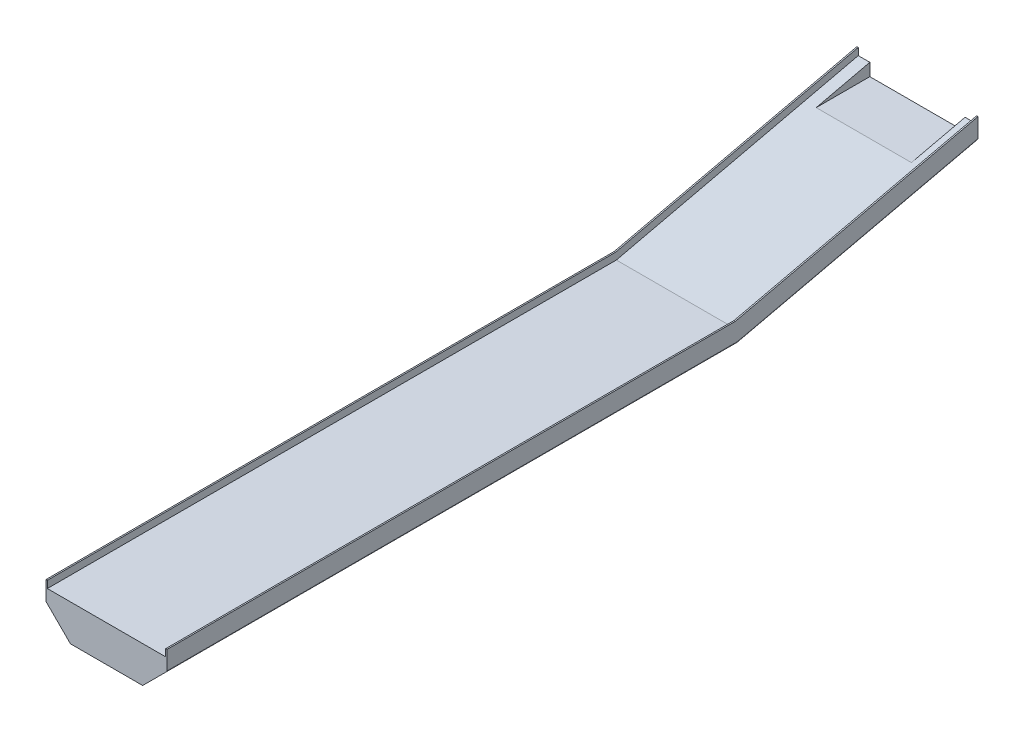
ISO-10303-21;
HEADER;
FILE_DESCRIPTION(('STEP AP214'),'2;1');
FILE_NAME('part.step','',(''),(''),'','','');
FILE_SCHEMA(('AUTOMOTIVE_DESIGN { 1 0 10303 214 1 1 1 1 }'));
ENDSEC;
DATA;
#1=APPLICATION_CONTEXT('core data for automotive mechanical design processes');
#2=APPLICATION_PROTOCOL_DEFINITION('international standard','automotive_design',2000,#1);
#3=PRODUCT_CONTEXT('',#1,'mechanical');
#4=PRODUCT('Part','Part','',(#3));
#5=PRODUCT_RELATED_PRODUCT_CATEGORY('part','',(#4));
#6=PRODUCT_DEFINITION_FORMATION('','',#4);
#7=PRODUCT_DEFINITION_CONTEXT('part definition',#1,'design');
#8=PRODUCT_DEFINITION('design','',#6,#7);
#9=PRODUCT_DEFINITION_SHAPE('','',#8);
#10=(LENGTH_UNIT() NAMED_UNIT(*) SI_UNIT(.MILLI.,.METRE.));
#11=(NAMED_UNIT(*) PLANE_ANGLE_UNIT() SI_UNIT($,.RADIAN.));
#12=(NAMED_UNIT(*) SI_UNIT($,.STERADIAN.) SOLID_ANGLE_UNIT());
#13=UNCERTAINTY_MEASURE_WITH_UNIT(LENGTH_MEASURE(1.E-05),#10,'distance_accuracy_value','');
#14=(GEOMETRIC_REPRESENTATION_CONTEXT(3) GLOBAL_UNCERTAINTY_ASSIGNED_CONTEXT((#13)) GLOBAL_UNIT_ASSIGNED_CONTEXT((#10,
#11,#12)) REPRESENTATION_CONTEXT('',''));
#15=CARTESIAN_POINT('',(0.,0.,0.));
#16=DIRECTION('',(0.,0.,1.));
#17=DIRECTION('',(1.,0.,0.));
#18=AXIS2_PLACEMENT_3D('',#15,#16,#17);
#19=CARTESIAN_POINT('',(-44.5235395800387,90.5080845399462,37.));
#20=DIRECTION('',(0.,0.,-1.));
#21=DIRECTION('',(-1.,0.,0.));
#22=AXIS2_PLACEMENT_3D('',#19,#20,#21);
#23=PLANE('',#22);
#24=CARTESIAN_POINT('',(43.50000036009,20.66690464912,37.));
#25=DIRECTION('',(0.,0.,1.));
#26=DIRECTION('',(0.,1.,0.));
#27=AXIS2_PLACEMENT_3D('',#24,#25,#26);
#28=CIRCLE('',#27,1.);
#29=CARTESIAN_POINT('',(44.207107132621,19.9597978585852,37.));
#30=VERTEX_POINT('',#29);
#31=CARTESIAN_POINT('',(44.50000036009,20.6669046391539,37.));
#32=VERTEX_POINT('',#31);
#33=EDGE_CURVE('E464',#30,#32,#28,.T.);
#34=ORIENTED_EDGE('',*,*,#33,.T.);
#35=DIRECTION('',(0.,-1.,0.));
#36=VECTOR('',#35,1.);
#37=CARTESIAN_POINT('',(44.50000036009,34.25269107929,37.));
#38=LINE('',#37,#36);
#39=CARTESIAN_POINT('',(44.50000036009,34.25269107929,37.));
#40=VERTEX_POINT('',#39);
#41=EDGE_CURVE('E399',#40,#32,#38,.T.);
#42=ORIENTED_EDGE('',*,*,#41,.F.);
#43=DIRECTION('',(1.,0.,0.));
#44=VECTOR('',#43,1.);
#45=CARTESIAN_POINT('',(44.00000036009,34.25269107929,37.));
#46=LINE('',#45,#44);
#47=CARTESIAN_POINT('',(43.50000036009,34.25269107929,37.));
#48=VERTEX_POINT('',#47);
#49=EDGE_CURVE('E415',#48,#40,#46,.T.);
#50=ORIENTED_EDGE('',*,*,#49,.F.);
#51=DIRECTION('',(0.,-1.,0.));
#52=VECTOR('',#51,1.);
#53=CARTESIAN_POINT('',(43.50000036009,34.25269107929,37.));
#54=LINE('',#53,#52);
#55=CARTESIAN_POINT('',(43.50000036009,28.9977093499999,37.));
#56=VERTEX_POINT('',#55);
#57=EDGE_CURVE('E450',#48,#56,#54,.T.);
#58=ORIENTED_EDGE('',*,*,#57,.T.);
#59=DIRECTION('',(-1.,0.,0.));
#60=VECTOR('',#59,1.);
#61=CARTESIAN_POINT('',(-44.5020003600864,28.9977093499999,37.));
#62=LINE('',#61,#60);
#63=CARTESIAN_POINT('',(-43.5000001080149,28.9977093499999,37.));
#64=VERTEX_POINT('',#63);
#65=EDGE_CURVE('E376',#56,#64,#62,.T.);
#66=ORIENTED_EDGE('',*,*,#65,.T.);
#67=DIRECTION('',(0.,-1.,0.));
#68=VECTOR('',#67,1.);
#69=CARTESIAN_POINT('',(-43.50000036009,34.25269107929,37.));
#70=LINE('',#69,#68);
#71=CARTESIAN_POINT('',(-43.50000036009,34.25269107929,37.));
#72=VERTEX_POINT('',#71);
#73=EDGE_CURVE('E380',#72,#64,#70,.T.);
#74=ORIENTED_EDGE('',*,*,#73,.F.);
#75=DIRECTION('',(-1.,0.,0.));
#76=VECTOR('',#75,1.);
#77=CARTESIAN_POINT('',(-44.00000036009,34.25269107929,37.));
#78=LINE('',#77,#76);
#79=CARTESIAN_POINT('',(-44.50000036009,34.25269107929,37.));
#80=VERTEX_POINT('',#79);
#81=EDGE_CURVE('E330',#72,#80,#78,.T.);
#82=ORIENTED_EDGE('',*,*,#81,.T.);
#83=DIRECTION('',(0.,-1.,0.));
#84=VECTOR('',#83,1.);
#85=CARTESIAN_POINT('',(-44.50000036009,34.25269107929,37.));
#86=LINE('',#85,#84);
#87=CARTESIAN_POINT('',(-44.5000003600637,20.6669046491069,37.));
#88=VERTEX_POINT('',#87);
#89=EDGE_CURVE('E353',#80,#88,#86,.T.);
#90=ORIENTED_EDGE('',*,*,#89,.T.);
#91=CARTESIAN_POINT('',(-43.50000036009,20.66690464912,37.));
#92=DIRECTION('',(0.,0.,1.));
#93=DIRECTION('',(0.,1.,0.));
#94=AXIS2_PLACEMENT_3D('',#91,#92,#93);
#95=CIRCLE('',#94,1.);
#96=CARTESIAN_POINT('',(-44.2071071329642,19.9597978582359,37.));
#97=VERTEX_POINT('',#96);
#98=EDGE_CURVE('E654',#88,#97,#95,.T.);
#99=ORIENTED_EDGE('',*,*,#98,.T.);
#100=DIRECTION('',(0.707106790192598,-0.707106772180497,0.));
#101=VECTOR('',#100,1.);
#102=CARTESIAN_POINT('',(-44.50000036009,20.25269107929,37.));
#103=LINE('',#102,#101);
#104=CARTESIAN_POINT('',(-26.8402020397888,2.59289320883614,37.));
#105=VERTEX_POINT('',#104);
#106=EDGE_CURVE('E430',#97,#105,#103,.T.);
#107=ORIENTED_EDGE('',*,*,#106,.T.);
#108=CARTESIAN_POINT('',(-26.13309526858,3.3,37.));
#109=DIRECTION('',(0.,0.,1.));
#110=DIRECTION('',(0.,1.,0.));
#111=AXIS2_PLACEMENT_3D('',#108,#109,#110);
#112=CIRCLE('',#111,1.);
#113=CARTESIAN_POINT('',(-26.133095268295,2.3,37.));
#114=VERTEX_POINT('',#113);
#115=EDGE_CURVE('E725',#105,#114,#112,.T.);
#116=ORIENTED_EDGE('',*,*,#115,.T.);
#117=DIRECTION('',(1.,0.,0.));
#118=VECTOR('',#117,1.);
#119=CARTESIAN_POINT('',(-26.54730882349,2.3,37.));
#120=LINE('',#119,#118);
#121=CARTESIAN_POINT('',(26.13309526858,2.3,37.));
#122=VERTEX_POINT('',#121);
#123=EDGE_CURVE('E349',#114,#122,#120,.T.);
#124=ORIENTED_EDGE('',*,*,#123,.T.);
#125=CARTESIAN_POINT('',(26.13309526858,3.3,37.));
#126=DIRECTION('',(0.,0.,1.));
#127=DIRECTION('',(0.,1.,0.));
#128=AXIS2_PLACEMENT_3D('',#125,#126,#127);
#129=CIRCLE('',#128,1.);
#130=CARTESIAN_POINT('',(26.8402020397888,2.5928932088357,37.));
#131=VERTEX_POINT('',#130);
#132=EDGE_CURVE('E350',#122,#131,#129,.T.);
#133=ORIENTED_EDGE('',*,*,#132,.T.);
#134=DIRECTION('',(-0.707106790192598,-0.707106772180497,0.));
#135=VECTOR('',#134,1.);
#136=CARTESIAN_POINT('',(44.50000036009,20.25269107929,37.));
#137=LINE('',#136,#135);
#138=EDGE_CURVE('E389',#30,#131,#137,.T.);
#139=ORIENTED_EDGE('',*,*,#138,.F.);
#140=EDGE_LOOP('',(#34,#42,#50,#58,#66,#74,#82,#90,#99,#107,#116,#124,#133,#139));
#141=FACE_BOUND('',#140,.T.);
#142=ADVANCED_FACE('F16',(#141),#23,.F.);
#143=CARTESIAN_POINT('',(-44.5235395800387,130.995206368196,-559.));
#144=DIRECTION('',(0.,0.,1.));
#145=DIRECTION('',(1.,0.,0.));
#146=AXIS2_PLACEMENT_3D('',#143,#144,#145);
#147=PLANE('',#146);
#148=DIRECTION('',(-0.69786879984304,0.716225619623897,0.));
#149=VECTOR('',#148,1.);
#150=CARTESIAN_POINT('',(-27.1860108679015,43.299551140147,-559.));
#151=LINE('',#150,#149);
#152=CARTESIAN_POINT('',(-26.8402020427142,42.9446461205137,-559.));
#153=VERTEX_POINT('',#152);
#154=CARTESIAN_POINT('',(-44.2071071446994,60.7683722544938,-559.));
#155=VERTEX_POINT('',#154);
#156=EDGE_CURVE('E290',#153,#155,#151,.T.);
#157=ORIENTED_EDGE('',*,*,#156,.T.);
#158=CARTESIAN_POINT('',(-44.2071071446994,60.7683722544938,-559.));
#159=CARTESIAN_POINT('',(-44.3971499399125,60.963413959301,-559.));
#160=CARTESIAN_POINT('',(-44.5000003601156,61.2182482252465,-559.));
#161=CARTESIAN_POINT('',(-44.5000003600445,61.4940788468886,-559.));
#162=(BOUNDED_CURVE() B_SPLINE_CURVE(3,(#158,#159,#160,#161),.UNSPECIFIED.,.F.,
.F.) B_SPLINE_CURVE_WITH_KNOTS((4,4),(0.78539816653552,1.5707963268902),
.UNSPECIFIED.) CURVE() GEOMETRIC_REPRESENTATION_ITEM() RATIONAL_B_SPLINE_CURVE((1.,
0.94925302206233,0.94925302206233,1.)) REPRESENTATION_ITEM(''));
#163=CARTESIAN_POINT('',(-44.5000003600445,61.4940788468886,-559.));
#164=VERTEX_POINT('',#163);
#165=EDGE_CURVE('E740',#155,#164,#162,.T.);
#166=ORIENTED_EDGE('',*,*,#165,.T.);
#167=DIRECTION('',(0.,1.,0.));
#168=VECTOR('',#167,1.);
#169=CARTESIAN_POINT('',(-44.50000036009,34.25269107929,-559.));
#170=LINE('',#169,#168);
#171=CARTESIAN_POINT('',(-44.50000036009,75.4372277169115,-559.));
#172=VERTEX_POINT('',#171);
#173=EDGE_CURVE('E305',#164,#172,#170,.T.);
#174=ORIENTED_EDGE('',*,*,#173,.T.);
#175=DIRECTION('',(1.,0.,0.));
#176=VECTOR('',#175,1.);
#177=CARTESIAN_POINT('',(-44.00000036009,75.4372277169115,-559.));
#178=LINE('',#177,#176);
#179=CARTESIAN_POINT('',(-43.50000036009,75.4372277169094,-559.));
#180=VERTEX_POINT('',#179);
#181=EDGE_CURVE('E323',#172,#180,#178,.T.);
#182=ORIENTED_EDGE('',*,*,#181,.T.);
#183=DIRECTION('',(0.,1.,0.));
#184=VECTOR('',#183,1.);
#185=CARTESIAN_POINT('',(-43.50000036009,34.25269107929,-559.));
#186=LINE('',#185,#184);
#187=CARTESIAN_POINT('',(-43.5000003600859,70.218941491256,-559.));
#188=VERTEX_POINT('',#187);
#189=EDGE_CURVE('E358',#188,#180,#186,.T.);
#190=ORIENTED_EDGE('',*,*,#189,.F.);
#191=DIRECTION('',(1.,0.,0.));
#192=VECTOR('',#191,1.);
#193=CARTESIAN_POINT('',(-44.5020003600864,70.218941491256,-559.));
#194=LINE('',#193,#192);
#195=CARTESIAN_POINT('',(-35.,70.218941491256,-559.));
#196=VERTEX_POINT('',#195);
#197=EDGE_CURVE('E297',#188,#196,#194,.T.);
#198=ORIENTED_EDGE('',*,*,#197,.T.);
#199=DIRECTION('',(0.,1.,0.));
#200=VECTOR('',#199,1.);
#201=CARTESIAN_POINT('',(-35.,131.07828834,-559.));
#202=LINE('',#201,#200);
#203=CARTESIAN_POINT('',(-35.,61.07828834,-559.));
#204=VERTEX_POINT('',#203);
#205=EDGE_CURVE('E27',#204,#196,#202,.T.);
#206=ORIENTED_EDGE('',*,*,#205,.F.);
#207=DIRECTION('',(-1.,0.,0.));
#208=VECTOR('',#207,1.);
#209=CARTESIAN_POINT('',(35.,61.07828834,-559.));
#210=LINE('',#209,#208);
#211=CARTESIAN_POINT('',(35.,61.07828834,-559.));
#212=VERTEX_POINT('',#211);
#213=EDGE_CURVE('E10',#212,#204,#210,.T.);
#214=ORIENTED_EDGE('',*,*,#213,.F.);
#215=DIRECTION('',(0.,-1.,0.));
#216=VECTOR('',#215,1.);
#217=CARTESIAN_POINT('',(35.,131.07828834,-559.));
#218=LINE('',#217,#216);
#219=CARTESIAN_POINT('',(35.,70.218941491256,-559.));
#220=VERTEX_POINT('',#219);
#221=EDGE_CURVE('E439',#220,#212,#218,.T.);
#222=ORIENTED_EDGE('',*,*,#221,.F.);
#223=DIRECTION('',(1.,0.,0.));
#224=VECTOR('',#223,1.);
#225=CARTESIAN_POINT('',(-44.5020003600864,70.218941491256,-559.));
#226=LINE('',#225,#224);
#227=CARTESIAN_POINT('',(43.5000003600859,70.218941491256,-559.));
#228=VERTEX_POINT('',#227);
#229=EDGE_CURVE('E366',#220,#228,#226,.T.);
#230=ORIENTED_EDGE('',*,*,#229,.T.);
#231=DIRECTION('',(0.,1.,0.));
#232=VECTOR('',#231,1.);
#233=CARTESIAN_POINT('',(43.50000036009,34.25269107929,-559.));
#234=LINE('',#233,#232);
#235=CARTESIAN_POINT('',(43.50000036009,75.437227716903,-559.));
#236=VERTEX_POINT('',#235);
#237=EDGE_CURVE('E312',#228,#236,#234,.T.);
#238=ORIENTED_EDGE('',*,*,#237,.T.);
#239=DIRECTION('',(-1.,0.,0.));
#240=VECTOR('',#239,1.);
#241=CARTESIAN_POINT('',(44.00000036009,75.4372277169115,-559.));
#242=LINE('',#241,#240);
#243=CARTESIAN_POINT('',(44.50000036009,75.4372277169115,-559.));
#244=VERTEX_POINT('',#243);
#245=EDGE_CURVE('E371',#244,#236,#242,.T.);
#246=ORIENTED_EDGE('',*,*,#245,.F.);
#247=DIRECTION('',(0.,1.,0.));
#248=VECTOR('',#247,1.);
#249=CARTESIAN_POINT('',(44.50000036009,34.25269107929,-559.));
#250=LINE('',#249,#248);
#251=CARTESIAN_POINT('',(44.5000003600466,61.4940788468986,-559.));
#252=VERTEX_POINT('',#251);
#253=EDGE_CURVE('E407',#252,#244,#250,.T.);
#254=ORIENTED_EDGE('',*,*,#253,.F.);
#255=CARTESIAN_POINT('',(44.5000003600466,61.4940788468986,-559.));
#256=CARTESIAN_POINT('',(44.5000003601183,61.2182482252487,-559.));
#257=CARTESIAN_POINT('',(44.3971499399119,60.9634139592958,-559.));
#258=CARTESIAN_POINT('',(44.2071071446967,60.76837225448,-559.));
#259=(BOUNDED_CURVE() B_SPLINE_CURVE(3,(#255,#256,#257,#258),.UNSPECIFIED.,.F.,
.F.) B_SPLINE_CURVE_WITH_KNOTS((4,4),(1.5707963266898,2.35619448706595),
.UNSPECIFIED.) CURVE() GEOMETRIC_REPRESENTATION_ITEM() RATIONAL_B_SPLINE_CURVE((1.,
0.949253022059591,0.949253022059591,1.)) REPRESENTATION_ITEM(''));
#260=CARTESIAN_POINT('',(44.2071071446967,60.76837225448,-559.));
#261=VERTEX_POINT('',#260);
#262=EDGE_CURVE('E335',#252,#261,#259,.T.);
#263=ORIENTED_EDGE('',*,*,#262,.T.);
#264=DIRECTION('',(0.69786879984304,0.716225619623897,0.));
#265=VECTOR('',#264,1.);
#266=CARTESIAN_POINT('',(27.1860108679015,43.299551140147,-559.));
#267=LINE('',#266,#265);
#268=CARTESIAN_POINT('',(26.8402020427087,42.9446461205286,-559.));
#269=VERTEX_POINT('',#268);
#270=EDGE_CURVE('E416',#269,#261,#267,.T.);
#271=ORIENTED_EDGE('',*,*,#270,.F.);
#272=CARTESIAN_POINT('',(26.8402020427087,42.9446461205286,-559.));
#273=CARTESIAN_POINT('',(26.6501592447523,42.7496044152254,-559.));
#274=CARTESIAN_POINT('',(26.4018563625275,42.6440486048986,-559.));
#275=CARTESIAN_POINT('',(26.13309525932,42.6440486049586,-559.));
#276=(BOUNDED_CURVE() B_SPLINE_CURVE(3,(#272,#273,#274,#275),.UNSPECIFIED.,.F.,
.F.) B_SPLINE_CURVE_WITH_KNOTS((4,4),(2.35619448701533,3.14159265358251),
.UNSPECIFIED.) CURVE() GEOMETRIC_REPRESENTATION_ITEM() RATIONAL_B_SPLINE_CURVE((1.,
0.949253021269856,0.949253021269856,1.)) REPRESENTATION_ITEM(''));
#277=CARTESIAN_POINT('',(26.13309525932,42.6440486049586,-559.));
#278=VERTEX_POINT('',#277);
#279=EDGE_CURVE('E263',#269,#278,#276,.T.);
#280=ORIENTED_EDGE('',*,*,#279,.T.);
#281=DIRECTION('',(1.,0.,0.));
#282=VECTOR('',#281,1.);
#283=CARTESIAN_POINT('',(0.,42.6440486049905,-559.));
#284=LINE('',#283,#282);
#285=CARTESIAN_POINT('',(-26.1330952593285,42.6440486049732,-559.));
#286=VERTEX_POINT('',#285);
#287=EDGE_CURVE('E256',#286,#278,#284,.T.);
#288=ORIENTED_EDGE('',*,*,#287,.F.);
#289=CARTESIAN_POINT('',(-26.1330952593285,42.6440486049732,-559.));
#290=CARTESIAN_POINT('',(-26.4018563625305,42.6440486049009,-559.));
#291=CARTESIAN_POINT('',(-26.6501592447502,42.7496044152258,-559.));
#292=CARTESIAN_POINT('',(-26.8402020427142,42.9446461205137,-559.));
#293=(BOUNDED_CURVE() B_SPLINE_CURVE(3,(#289,#290,#291,#292),.UNSPECIFIED.,.F.,
.F.) B_SPLINE_CURVE_WITH_KNOTS((4,4),(1.58033207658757E-11,0.78539816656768),
.UNSPECIFIED.) CURVE() GEOMETRIC_REPRESENTATION_ITEM() RATIONAL_B_SPLINE_CURVE((1.,
0.949253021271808,0.949253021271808,1.)) REPRESENTATION_ITEM(''));
#294=EDGE_CURVE('E260',#286,#153,#293,.T.);
#295=ORIENTED_EDGE('',*,*,#294,.T.);
#296=EDGE_LOOP('',(#157,#166,#174,#182,#190,#198,#206,#214,#222,#230,#238,#246,#254,#263,#271,
#280,#288,#295));
#297=FACE_BOUND('',#296,.T.);
#298=ADVANCED_FACE('F258',(#297),#147,.F.);
#299=CARTESIAN_POINT('',(35.,61.07828834,41.000025));
#300=DIRECTION('',(0.,-1.,0.));
#301=DIRECTION('',(-1.,0.,0.));
#302=AXIS2_PLACEMENT_3D('',#299,#300,#301);
#303=PLANE('',#302);
#304=DIRECTION('',(0.,0.,-1.));
#305=VECTOR('',#304,1.);
#306=CARTESIAN_POINT('',(35.,61.07828834,41.000025));
#307=LINE('',#306,#305);
#308=CARTESIAN_POINT('',(35.,61.07828834,-519.575564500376));
#309=VERTEX_POINT('',#308);
#310=EDGE_CURVE('E388',#309,#212,#307,.T.);
#311=ORIENTED_EDGE('',*,*,#310,.T.);
#312=ORIENTED_EDGE('',*,*,#213,.T.);
#313=DIRECTION('',(0.,0.,-1.));
#314=VECTOR('',#313,1.);
#315=CARTESIAN_POINT('',(-35.,61.07828834,41.000025));
#316=LINE('',#315,#314);
#317=CARTESIAN_POINT('',(-35.,61.07828834,-519.575564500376));
#318=VERTEX_POINT('',#317);
#319=EDGE_CURVE('E384',#318,#204,#316,.T.);
#320=ORIENTED_EDGE('',*,*,#319,.F.);
#321=DIRECTION('',(1.,0.,0.));
#322=VECTOR('',#321,1.);
#323=CARTESIAN_POINT('',(-44.5020003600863,61.07828834,-519.575564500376));
#324=LINE('',#323,#322);
#325=EDGE_CURVE('E306',#318,#309,#324,.T.);
#326=ORIENTED_EDGE('',*,*,#325,.T.);
#327=EDGE_LOOP('',(#311,#312,#320,#326));
#328=FACE_BOUND('',#327,.T.);
#329=ADVANCED_FACE('F585',(#328),#303,.F.);
#330=CARTESIAN_POINT('',(-35.,131.07828834,41.000025));
#331=DIRECTION('',(-1.,0.,0.));
#332=DIRECTION('',(0.,0.,1.));
#333=AXIS2_PLACEMENT_3D('',#330,#331,#332);
#334=PLANE('',#333);
#335=ORIENTED_EDGE('',*,*,#319,.T.);
#336=ORIENTED_EDGE('',*,*,#205,.T.);
#337=DIRECTION('',(0.,-0.225861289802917,0.97415947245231));
#338=VECTOR('',#337,1.);
#339=CARTESIAN_POINT('',(-35.,28.9977093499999,-381.209225));
#340=LINE('',#339,#338);
#341=EDGE_CURVE('E310',#196,#318,#340,.T.);
#342=ORIENTED_EDGE('',*,*,#341,.T.);
#343=EDGE_LOOP('',(#335,#336,#342));
#344=FACE_BOUND('',#343,.T.);
#345=ADVANCED_FACE('F569',(#344),#334,.F.);
#346=CARTESIAN_POINT('',(35.,131.07828834,41.000025));
#347=DIRECTION('',(1.,0.,0.));
#348=DIRECTION('',(0.,-1.,0.));
#349=AXIS2_PLACEMENT_3D('',#346,#347,#348);
#350=PLANE('',#349);
#351=DIRECTION('',(0.,0.225861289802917,-0.97415947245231));
#352=VECTOR('',#351,1.);
#353=CARTESIAN_POINT('',(35.,28.9977093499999,-381.209225));
#354=LINE('',#353,#352);
#355=EDGE_CURVE('E311',#309,#220,#354,.T.);
#356=ORIENTED_EDGE('',*,*,#355,.T.);
#357=ORIENTED_EDGE('',*,*,#221,.T.);
#358=ORIENTED_EDGE('',*,*,#310,.F.);
#359=EDGE_LOOP('',(#356,#357,#358));
#360=FACE_BOUND('',#359,.T.);
#361=ADVANCED_FACE('F566',(#360),#350,.F.);
#362=CARTESIAN_POINT('',(-44.5020003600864,28.9977093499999,41.));
#363=DIRECTION('',(0.,1.,0.));
#364=DIRECTION('',(1.,0.,0.));
#365=AXIS2_PLACEMENT_3D('',#362,#363,#364);
#366=PLANE('',#365);
#367=ORIENTED_EDGE('',*,*,#65,.F.);
#368=DIRECTION('',(0.,0.,-1.));
#369=VECTOR('',#368,1.);
#370=CARTESIAN_POINT('',(43.50000036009,28.9977093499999,41.));
#371=LINE('',#370,#369);
#372=CARTESIAN_POINT('',(43.50000036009,28.99770935,-381.209225));
#373=VERTEX_POINT('',#372);
#374=EDGE_CURVE('E411',#56,#373,#371,.T.);
#375=ORIENTED_EDGE('',*,*,#374,.T.);
#376=DIRECTION('',(1.,0.,0.));
#377=VECTOR('',#376,1.);
#378=CARTESIAN_POINT('',(-44.5020003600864,28.9977093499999,-381.209225));
#379=LINE('',#378,#377);
#380=CARTESIAN_POINT('',(-43.50000036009,28.99770935,-381.209225));
#381=VERTEX_POINT('',#380);
#382=EDGE_CURVE('E304',#381,#373,#379,.T.);
#383=ORIENTED_EDGE('',*,*,#382,.F.);
#384=DIRECTION('',(0.,0.,1.));
#385=VECTOR('',#384,1.);
#386=CARTESIAN_POINT('',(-43.50000036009,28.9977093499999,41.));
#387=LINE('',#386,#385);
#388=EDGE_CURVE('E363',#381,#64,#387,.T.);
#389=ORIENTED_EDGE('',*,*,#388,.T.);
#390=EDGE_LOOP('',(#367,#375,#383,#389));
#391=FACE_BOUND('',#390,.T.);
#392=ADVANCED_FACE('F564',(#391),#366,.T.);
#393=CARTESIAN_POINT('',(-44.5020003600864,28.9977093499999,-381.209225));
#394=DIRECTION('',(0.,0.97415947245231,0.225861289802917));
#395=DIRECTION('',(1.,0.,0.));
#396=AXIS2_PLACEMENT_3D('',#393,#394,#395);
#397=PLANE('',#396);
#398=ORIENTED_EDGE('',*,*,#197,.F.);
#399=DIRECTION('',(0.,-0.225861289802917,0.97415947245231));
#400=VECTOR('',#399,1.);
#401=CARTESIAN_POINT('',(-43.50000036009,28.9977093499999,-381.209225));
#402=LINE('',#401,#400);
#403=EDGE_CURVE('E359',#188,#381,#402,.T.);
#404=ORIENTED_EDGE('',*,*,#403,.T.);
#405=ORIENTED_EDGE('',*,*,#382,.T.);
#406=DIRECTION('',(0.,0.225861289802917,-0.97415947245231));
#407=VECTOR('',#406,1.);
#408=CARTESIAN_POINT('',(43.50000036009,28.9977093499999,-381.209225));
#409=LINE('',#408,#407);
#410=EDGE_CURVE('E316',#373,#228,#409,.T.);
#411=ORIENTED_EDGE('',*,*,#410,.T.);
#412=ORIENTED_EDGE('',*,*,#229,.F.);
#413=ORIENTED_EDGE('',*,*,#355,.F.);
#414=ORIENTED_EDGE('',*,*,#325,.F.);
#415=ORIENTED_EDGE('',*,*,#341,.F.);
#416=EDGE_LOOP('',(#398,#404,#405,#411,#412,#413,#414,#415));
#417=FACE_BOUND('',#416,.T.);
#418=ADVANCED_FACE('F560',(#417),#397,.T.);
#419=CARTESIAN_POINT('',(-44.50000036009,34.25269107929,40.));
#420=DIRECTION('',(-1.,0.,0.));
#421=DIRECTION('',(0.,0.,1.));
#422=AXIS2_PLACEMENT_3D('',#419,#420,#421);
#423=PLANE('',#422);
#424=ORIENTED_EDGE('',*,*,#89,.F.);
#425=DIRECTION('',(0.,0.,1.));
#426=VECTOR('',#425,1.);
#427=CARTESIAN_POINT('',(-44.50000036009,34.25269107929,-380.6101693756));
#428=LINE('',#427,#426);
#429=CARTESIAN_POINT('',(-44.50000036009,34.25269107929,-380.6101693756));
#430=VERTEX_POINT('',#429);
#431=EDGE_CURVE('E334',#430,#80,#428,.T.);
#432=ORIENTED_EDGE('',*,*,#431,.F.);
#433=DIRECTION('',(0.,-0.224951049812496,0.974370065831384));
#434=VECTOR('',#433,1.);
#435=CARTESIAN_POINT('',(-44.50000036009,75.8470300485,-560.7750489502));
#436=LINE('',#435,#434);
#437=EDGE_CURVE('E318',#172,#430,#436,.T.);
#438=ORIENTED_EDGE('',*,*,#437,.F.);
#439=ORIENTED_EDGE('',*,*,#173,.F.);
#440=DIRECTION('',(-2.81747493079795E-11,0.224951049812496,-0.974370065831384));
#441=VECTOR('',#440,1.);
#442=CARTESIAN_POINT('',(-44.50000035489,20.70315084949,-382.3150757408));
#443=LINE('',#442,#441);
#444=CARTESIAN_POINT('',(-44.5000003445,20.70315085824,-382.315075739));
#445=VERTEX_POINT('',#444);
#446=EDGE_CURVE('E795',#445,#164,#443,.T.);
#447=ORIENTED_EDGE('',*,*,#446,.F.);
#448=CARTESIAN_POINT('',(-44.49999564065,22.07909330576,-381.9971776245));
#449=DIRECTION('',(0.99999999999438,-3.33095614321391E-06,-3.79520581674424E-07));
#450=DIRECTION('',(-3.33089409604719E-06,-0.999999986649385,0.000163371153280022));
#451=AXIS2_PLACEMENT_3D('',#448,#449,#450);
#452=CIRCLE('',#451,1.412188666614);
#453=CARTESIAN_POINT('',(-44.50000035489,20.66690464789,-381.9969469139));
#454=VERTEX_POINT('',#453);
#455=EDGE_CURVE('E804',#454,#445,#452,.T.);
#456=ORIENTED_EDGE('',*,*,#455,.F.);
#457=DIRECTION('',(-1.228470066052E-11,2.904192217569E-12,1.));
#458=VECTOR('',#457,1.);
#459=CARTESIAN_POINT('',(-44.50000035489,20.66690464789,-381.9969469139));
#460=LINE('',#459,#458);
#461=EDGE_CURVE('E657',#454,#88,#460,.T.);
#462=ORIENTED_EDGE('',*,*,#461,.T.);
#463=EDGE_LOOP('',(#424,#432,#438,#439,#447,#456,#462));
#464=FACE_BOUND('',#463,.T.);
#465=ADVANCED_FACE('F556',(#464),#423,.T.);
#466=CARTESIAN_POINT('',(-26.54730882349,2.3,40.));
#467=DIRECTION('',(0.,-1.,0.));
#468=DIRECTION('',(0.,0.,-1.));
#469=AXIS2_PLACEMENT_3D('',#466,#467,#468);
#470=PLANE('',#469);
#471=ORIENTED_EDGE('',*,*,#123,.F.);
#472=DIRECTION('',(1.33603980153E-12,0.,-1.));
#473=VECTOR('',#472,1.);
#474=CARTESIAN_POINT('',(-26.13309526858,2.3,41.));
#475=LINE('',#474,#473);
#476=CARTESIAN_POINT('',(-26.13309526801,2.3,-383.908916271));
#477=VERTEX_POINT('',#476);
#478=EDGE_CURVE('E630',#114,#477,#475,.T.);
#479=ORIENTED_EDGE('',*,*,#478,.T.);
#480=DIRECTION('',(1.,0.,0.));
#481=VECTOR('',#480,1.);
#482=CARTESIAN_POINT('',(-26.13309526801,2.3,-383.908916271));
#483=LINE('',#482,#481);
#484=CARTESIAN_POINT('',(26.13309526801,2.3,-383.908916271));
#485=VERTEX_POINT('',#484);
#486=EDGE_CURVE('E324',#477,#485,#483,.T.);
#487=ORIENTED_EDGE('',*,*,#486,.T.);
#488=DIRECTION('',(1.33603980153E-12,0.,1.));
#489=VECTOR('',#488,1.);
#490=CARTESIAN_POINT('',(26.13309526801,2.3,-383.908916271));
#491=LINE('',#490,#489);
#492=EDGE_CURVE('E342',#485,#122,#491,.T.);
#493=ORIENTED_EDGE('',*,*,#492,.T.);
#494=EDGE_LOOP('',(#471,#479,#487,#493));
#495=FACE_BOUND('',#494,.T.);
#496=ADVANCED_FACE('F559',(#495),#470,.T.);
#497=CARTESIAN_POINT('',(26.13309526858,3.3,870.1873626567));
#498=DIRECTION('',(0.,0.,1.));
#499=DIRECTION('',(0.,-1.,0.));
#500=AXIS2_PLACEMENT_3D('',#497,#498,#499);
#501=CYLINDRICAL_SURFACE('',#500,1.);
#502=ORIENTED_EDGE('',*,*,#132,.F.);
#503=ORIENTED_EDGE('',*,*,#492,.F.);
#504=CARTESIAN_POINT('',(26.84020203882,2.592893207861,-383.9756581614));
#505=CARTESIAN_POINT('',(26.80423588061,2.556928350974,-383.9674627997));
#506=CARTESIAN_POINT('',(26.72769287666,2.491248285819,-383.9524872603));
#507=CARTESIAN_POINT('',(26.59947278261,2.411186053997,-383.9342466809));
#508=CARTESIAN_POINT('',(26.45901059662,2.350390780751,-383.9203930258));
#509=CARTESIAN_POINT('',(26.30250765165,2.309742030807,-383.911127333));
#510=CARTESIAN_POINT('',(26.19130301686,2.300001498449,-383.9089166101));
#511=CARTESIAN_POINT('',(26.13309526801,2.3,-383.908916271));
#512=(BOUNDED_CURVE() B_SPLINE_CURVE(3,(#504,#505,#506,#507,#508,#509,#510,#511),.UNSPECIFIED.,
.F.,.F.) B_SPLINE_CURVE_WITH_KNOTS((4,1,1,1,1,4),(0.,0.1952372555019,0.3851458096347,
0.5766884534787,0.7780147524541,1.),
.UNSPECIFIED.) CURVE() GEOMETRIC_REPRESENTATION_ITEM() RATIONAL_B_SPLINE_CURVE((1.,1.,1.,1.,1.,
1.,1.,1.)) REPRESENTATION_ITEM(''));
#513=CARTESIAN_POINT('',(26.84020203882,2.592893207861,-383.9756581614));
#514=VERTEX_POINT('',#513);
#515=EDGE_CURVE('E406',#514,#485,#512,.T.);
#516=ORIENTED_EDGE('',*,*,#515,.F.);
#517=DIRECTION('',(-4.566551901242E-12,-4.581365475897E-12,-1.));
#518=VECTOR('',#517,1.);
#519=CARTESIAN_POINT('',(26.84020204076,2.592893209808,41.));
#520=LINE('',#519,#518);
#521=EDGE_CURVE('E393',#131,#514,#520,.T.);
#522=ORIENTED_EDGE('',*,*,#521,.F.);
#523=EDGE_LOOP('',(#502,#503,#516,#522));
#524=FACE_BOUND('',#523,.T.);
#525=ADVANCED_FACE('F521',(#524),#501,.T.);
#526=CARTESIAN_POINT('',(27.00194593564,2.994829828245,-384.7241311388));
#527=CARTESIAN_POINT('',(26.96526524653,2.8843907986,-384.7041732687));
#528=CARTESIAN_POINT('',(26.87842185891,2.73611676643,-384.6715828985));
#529=CARTESIAN_POINT('',(26.71803999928,2.583204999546,-384.6390553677));
#530=CARTESIAN_POINT('',(26.59487053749,2.498846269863,-384.621420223));
#531=CARTESIAN_POINT('',(26.45738965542,2.434107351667,-384.6080679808));
#532=CARTESIAN_POINT('',(26.30223801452,2.390485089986,-384.5991591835));
#533=CARTESIAN_POINT('',(26.06680699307,2.368218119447,-384.5946422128));
#534=CARTESIAN_POINT('',(25.88523390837,2.405106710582,-384.6021138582));
#535=CARTESIAN_POINT('',(25.77454973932,2.454427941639,-384.604635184));
#536=CARTESIAN_POINT('',(27.04176215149,2.951346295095,-384.4969710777));
#537=CARTESIAN_POINT('',(27.00042476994,2.836909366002,-384.4750674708));
#538=CARTESIAN_POINT('',(26.90641389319,2.685221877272,-384.4422162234));
#539=CARTESIAN_POINT('',(26.73761663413,2.53020495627,-384.4093555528));
#540=CARTESIAN_POINT('',(26.60923223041,2.445082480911,-384.3915167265));
#541=CARTESIAN_POINT('',(26.46689225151,2.37999155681,-384.3779967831));
#542=CARTESIAN_POINT('',(26.30698582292,2.336246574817,-384.3689695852));
#543=CARTESIAN_POINT('',(26.06494585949,2.313951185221,-384.3643891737));
#544=CARTESIAN_POINT('',(25.87827882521,2.350887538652,-384.3719698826));
#545=CARTESIAN_POINT('',(25.76369217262,2.400902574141,-384.3772693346));
#546=CARTESIAN_POINT('',(27.05629406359,2.91846090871,-384.2650866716));
#547=CARTESIAN_POINT('',(27.01154061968,2.803178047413,-384.2411991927));
#548=CARTESIAN_POINT('',(26.91307506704,2.652195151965,-384.2080816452));
#549=CARTESIAN_POINT('',(26.74059171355,2.499237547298,-384.1748809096));
#550=CARTESIAN_POINT('',(26.61055171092,2.415625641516,-384.1568341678));
#551=CARTESIAN_POINT('',(26.4672695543,2.351914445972,-384.143143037));
#552=CARTESIAN_POINT('',(26.30698627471,2.309206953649,-384.1339949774));
#553=CARTESIAN_POINT('',(26.0649452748,2.287473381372,-384.1293498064));
#554=CARTESIAN_POINT('',(25.87828037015,2.323479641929,-384.1370418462));
#555=CARTESIAN_POINT('',(25.76294422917,2.372844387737,-384.1451748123));
#556=CARTESIAN_POINT('',(27.04533960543,2.896630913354,-384.0317065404));
#557=CARTESIAN_POINT('',(26.99845822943,2.783665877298,-384.0058203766));
#558=CARTESIAN_POINT('',(26.89831275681,2.637495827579,-383.9724348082));
#559=CARTESIAN_POINT('',(26.72692386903,2.490733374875,-383.9388918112));
#560=CARTESIAN_POINT('',(26.59881063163,2.410885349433,-383.9206358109));
#561=CARTESIAN_POINT('',(26.4585163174,2.350266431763,-383.9067723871));
#562=CARTESIAN_POINT('',(26.30223936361,2.309742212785,-383.8975026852));
#563=CARTESIAN_POINT('',(26.0668052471,2.289152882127,-383.8927923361));
#564=CARTESIAN_POINT('',(25.88523852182,2.323264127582,-383.9005964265));
#565=CARTESIAN_POINT('',(25.77231623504,2.370643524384,-383.9115830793));
#566=(BOUNDED_SURFACE() B_SPLINE_SURFACE(3,3,((#526,#527,#528,#529,#530,#531,#532,#533,#534,
#535),(#536,#537,#538,#539,#540,#541,#542,#543,#544,#545),(#546,#547,#548,#549,#550,#551,#552,
#553,#554,#555),(#556,#557,#558,#559,#560,#561,#562,#563,#564,#565)),.UNSPECIFIED.,.F.,.F.,
.F.) B_SPLINE_SURFACE_WITH_KNOTS((4,4),(4,1,1,1,1,1,1,4),(0.,1.),(-0.4775377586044,0.,
0.1952372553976,0.3851458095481,0.5766884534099,0.778014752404,1.,1.474313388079),
.UNSPECIFIED.) GEOMETRIC_REPRESENTATION_ITEM() RATIONAL_B_SPLINE_SURFACE(((1.003488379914,
1.003488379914,1.003488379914,1.003488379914,1.003488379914,1.003488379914,1.003488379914,
1.003488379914,1.003488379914,1.003488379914),(0.9988372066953,0.9988372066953,0.9988372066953,
0.9988372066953,0.9988372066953,0.9988372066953,0.9988372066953,0.9988372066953,0.9988372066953,
0.9988372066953),(0.9988372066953,0.9988372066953,0.9988372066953,0.9988372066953,
0.9988372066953,0.9988372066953,0.9988372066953,0.9988372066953,0.9988372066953,
0.9988372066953),(1.003488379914,1.003488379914,1.003488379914,1.003488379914,1.003488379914,
1.003488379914,1.003488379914,1.003488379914,1.003488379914,1.003488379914))) REPRESENTATION_ITEM('') SURFACE());
#567=CARTESIAN_POINT('',(26.13309526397,5.3,-383.908916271));
#568=DIRECTION('',(-1.,0.,0.));
#569=DIRECTION('',(0.,-0.974370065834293,-0.224951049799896));
#570=AXIS2_PLACEMENT_3D('',#567,#568,#569);
#571=CIRCLE('',#570,3.);
#572=CARTESIAN_POINT('',(26.13309525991,2.376889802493,-384.5837694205));
#573=VERTEX_POINT('',#572);
#574=EDGE_CURVE('E329',#573,#485,#571,.T.);
#575=CARTESIAN_POINT('',(26.13309525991,2.37688980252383,-384.583769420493));
#576=CARTESIAN_POINT('',(26.143427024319,2.37689017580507,-384.583769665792));
#577=CARTESIAN_POINT('',(26.1537587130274,2.37703776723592,-384.583691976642));
#578=CARTESIAN_POINT('',(26.1744691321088,2.37762809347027,-384.583383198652));
#579=CARTESIAN_POINT('',(26.1848478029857,2.37807247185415,-384.583151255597));
#580=CARTESIAN_POINT('',(26.2056401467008,2.3792602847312,-384.582534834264));
#581=CARTESIAN_POINT('',(26.21605370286,2.38000533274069,-384.582149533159));
#582=CARTESIAN_POINT('',(26.2369033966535,2.38179864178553,-384.581227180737));
#583=CARTESIAN_POINT('',(26.2473393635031,2.38284848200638,-384.580689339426));
#584=CARTESIAN_POINT('',(26.2682210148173,2.38525555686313,-384.579462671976));
#585=CARTESIAN_POINT('',(26.2786664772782,2.38661433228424,-384.578773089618));
#586=CARTESIAN_POINT('',(26.2995537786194,2.3896439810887,-384.577243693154));
#587=CARTESIAN_POINT('',(26.3099953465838,2.3913163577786,-384.576403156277));
#588=CARTESIAN_POINT('',(26.330862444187,2.39497657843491,-384.574572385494));
#589=CARTESIAN_POINT('',(26.3412876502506,2.39696591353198,-384.573581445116));
#590=CARTESIAN_POINT('',(26.3621110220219,2.40126138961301,-384.571450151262));
#591=CARTESIAN_POINT('',(26.3725088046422,2.40356903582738,-384.570309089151));
#592=CARTESIAN_POINT('',(26.3932659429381,2.40850299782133,-384.567877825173));
#593=CARTESIAN_POINT('',(26.4036248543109,2.41113083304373,-384.566586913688));
#594=CARTESIAN_POINT('',(26.4242924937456,2.41670689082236,-384.563856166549));
#595=CARTESIAN_POINT('',(26.4346007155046,2.41965664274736,-384.562415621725));
#596=CARTESIAN_POINT('',(26.4551547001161,2.42587863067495,-384.559385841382));
#597=CARTESIAN_POINT('',(26.465399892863,2.42915240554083,-384.557795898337));
#598=CARTESIAN_POINT('',(26.4858154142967,2.4360230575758,-384.554467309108));
#599=CARTESIAN_POINT('',(26.4959851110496,2.43962147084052,-384.552727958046));
#600=CARTESIAN_POINT('',(26.5162371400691,2.4471405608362,-384.549100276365));
#601=CARTESIAN_POINT('',(26.5263187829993,2.45106275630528,-384.547211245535));
#602=CARTESIAN_POINT('',(26.5463816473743,2.45922886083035,-384.543283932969));
#603=CARTESIAN_POINT('',(26.5563621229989,2.46347426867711,-384.541244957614));
#604=CARTESIAN_POINT('',(26.5762091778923,2.47228609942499,-384.537017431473));
#605=CARTESIAN_POINT('',(26.5860749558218,2.47685399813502,-384.534828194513));
#606=CARTESIAN_POINT('',(26.605678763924,2.48631029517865,-384.530299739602));
#607=CARTESIAN_POINT('',(26.6154159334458,2.49120015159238,-384.527959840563));
#608=CARTESIAN_POINT('',(26.634750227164,2.50129798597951,-384.523129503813));
#609=CARTESIAN_POINT('',(26.6443464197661,2.50650741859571,-384.520638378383));
#610=CARTESIAN_POINT('',(26.6633864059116,2.51724194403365,-384.515504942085));
#611=CARTESIAN_POINT('',(26.6728291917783,2.52276849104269,-384.512861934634));
#612=CARTESIAN_POINT('',(26.6915495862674,2.5341346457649,-384.507424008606));
#613=CARTESIAN_POINT('',(26.7008261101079,2.53997570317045,-384.504628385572));
#614=CARTESIAN_POINT('',(26.719200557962,2.55196849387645,-384.498884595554));
#615=CARTESIAN_POINT('',(26.7282973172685,2.55812167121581,-384.495935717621));
#616=CARTESIAN_POINT('',(26.7462987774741,2.57073431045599,-384.489884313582));
#617=CARTESIAN_POINT('',(26.7552022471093,2.57719518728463,-384.486781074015));
#618=CARTESIAN_POINT('',(26.7728036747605,2.59041666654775,-384.480419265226));
#619=CARTESIAN_POINT('',(26.7815003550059,2.59717862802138,-384.477159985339));
#620=CARTESIAN_POINT('',(26.7986740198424,2.61099584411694,-384.470484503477));
#621=CARTESIAN_POINT('',(26.8071496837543,2.61805239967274,-384.467067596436));
#622=CARTESIAN_POINT('',(26.8238665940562,2.63245209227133,-384.460075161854));
#623=CARTESIAN_POINT('',(26.8321064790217,2.63979647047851,-384.456498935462));
#624=CARTESIAN_POINT('',(26.8402020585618,2.64726252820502,-384.452851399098));
#625=B_SPLINE_CURVE_WITH_KNOTS('',3,(#575,#576,#577,#578,#579,#580,#581,#582,#583,#584,#585,
#586,#587,#588,#589,#590,#591,#592,#593,#594,#595,#596,#597,#598,#599,#600,#601,#602,#603,#604,
#605,#606,#607,#608,#609,#610,#611,#612,#613,#614,#615,#616,#617,#618,#619,#620,#621,#622,#623,
#624),.UNSPECIFIED.,.F.,.F.,(4,2,2,2,2,2,2,2,2,2,2,2,2,2,2,2,2,2,2,2,2,2,2,2,4),(0.,
0.0309938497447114,0.0621607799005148,0.0934972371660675,0.124999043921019,0.156661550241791,
0.188479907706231,0.220452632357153,0.252582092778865,0.284870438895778,0.317319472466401,
0.349930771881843,0.382705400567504,0.415643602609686,0.448745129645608,0.482009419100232,
0.515436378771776,0.549028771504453,0.582789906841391,0.616722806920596,0.650830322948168,
0.685113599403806,0.719571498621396,0.754202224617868,0.789003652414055),.UNSPECIFIED.);
#626=CARTESIAN_POINT('',(26.84020205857,2.647262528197,-384.4528513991));
#627=VERTEX_POINT('',#626);
#628=EDGE_CURVE('E421',#573,#627,#625,.T.);
#629=CARTESIAN_POINT('',(24.71888170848,4.714213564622,-383.9756581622));
#630=DIRECTION('',(0.704823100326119,0.704823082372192,0.0803045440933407));
#631=DIRECTION('',(0.707106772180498,-0.707106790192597,0.));
#632=AXIS2_PLACEMENT_3D('',#629,#630,#631);
#633=CIRCLE('',#632,3.);
#634=EDGE_CURVE('E458',#514,#627,#633,.T.);
#635=ORIENTED_EDGE('',*,*,#574,.F.);
#636=ORIENTED_EDGE('',*,*,#628,.T.);
#637=ORIENTED_EDGE('',*,*,#634,.F.);
#638=ORIENTED_EDGE('',*,*,#515,.T.);
#639=EDGE_LOOP('',(#635,#636,#637,#638));
#640=FACE_BOUND('',#639,.T.);
#641=ADVANCED_FACE('F508',(#640),#566,.T.);
#642=CARTESIAN_POINT('',(173.2979149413,153.2932430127,-367.0471955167));
#643=DIRECTION('',(0.70482310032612,0.704823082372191,0.0803045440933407));
#644=DIRECTION('',(0.707106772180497,-0.707106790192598,0.));
#645=AXIS2_PLACEMENT_3D('',#642,#643,#644);
#646=CYLINDRICAL_SURFACE('',#645,3.);
#647=ORIENTED_EDGE('',*,*,#634,.T.);
#648=DIRECTION('',(0.70482310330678,0.70482307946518,0.0803045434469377));
#649=VECTOR('',#648,1.);
#650=CARTESIAN_POINT('',(26.8402020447,2.647262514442,-384.4528514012));
#651=LINE('',#650,#649);
#652=CARTESIAN_POINT('',(44.20710721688,20.01416709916,-382.4741401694));
#653=VERTEX_POINT('',#652);
#654=EDGE_CURVE('E341',#627,#653,#651,.T.);
#655=ORIENTED_EDGE('',*,*,#654,.T.);
#656=CARTESIAN_POINT('',(44.2071072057,19.95979778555,-381.9969469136));
#657=CARTESIAN_POINT('',(44.2081186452,19.96080630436,-382.0503980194));
#658=CARTESIAN_POINT('',(44.20946736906,19.96618933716,-382.1571673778));
#659=CARTESIAN_POINT('',(44.20946737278,19.98435306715,-382.3165883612));
#660=CARTESIAN_POINT('',(44.20811865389,20.00312588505,-382.4218321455));
#661=CARTESIAN_POINT('',(44.20710721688,20.01416709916,-382.4741401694));
#662=(BOUNDED_CURVE() B_SPLINE_CURVE(3,(#656,#657,#658,#659,#660,#661),.UNSPECIFIED.,.F.,
.F.) B_SPLINE_CURVE_WITH_KNOTS((4,1,1,4),(0.,0.3333333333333,0.6666666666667,1.),
.UNSPECIFIED.) CURVE() GEOMETRIC_REPRESENTATION_ITEM() RATIONAL_B_SPLINE_CURVE((1.,1.,1.,1.,1.,1.)) REPRESENTATION_ITEM(''));
#663=CARTESIAN_POINT('',(44.2071072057,19.95979778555,-381.9969469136));
#664=VERTEX_POINT('',#663);
#665=EDGE_CURVE('E467',#664,#653,#662,.T.);
#666=ORIENTED_EDGE('',*,*,#665,.F.);
#667=DIRECTION('',(-0.704823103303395,-0.704823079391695,-0.0803045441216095));
#668=VECTOR('',#667,1.);
#669=CARTESIAN_POINT('',(44.2071072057,19.95979778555,-381.9969469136));
#670=LINE('',#669,#668);
#671=EDGE_CURVE('E454',#664,#514,#670,.T.);
#672=ORIENTED_EDGE('',*,*,#671,.T.);
#673=EDGE_LOOP('',(#647,#655,#666,#672));
#674=FACE_BOUND('',#673,.T.);
#675=ADVANCED_FACE('F520',(#674),#646,.T.);
#676=CARTESIAN_POINT('',(44.50000036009,20.25269107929,40.));
#677=DIRECTION('',(-0.707106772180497,0.707106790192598,0.));
#678=DIRECTION('',(0.,0.,1.));
#679=AXIS2_PLACEMENT_3D('',#676,#677,#678);
#680=PLANE('',#679);
#681=DIRECTION('',(-1.735829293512E-10,1.734783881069E-10,1.));
#682=VECTOR('',#681,1.);
#683=CARTESIAN_POINT('',(44.2071072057,19.95979778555,-381.9969469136));
#684=LINE('',#683,#682);
#685=EDGE_CURVE('E394',#664,#30,#684,.T.);
#686=ORIENTED_EDGE('',*,*,#685,.T.);
#687=ORIENTED_EDGE('',*,*,#138,.T.);
#688=ORIENTED_EDGE('',*,*,#521,.T.);
#689=ORIENTED_EDGE('',*,*,#671,.F.);
#690=EDGE_LOOP('',(#686,#687,#688,#689));
#691=FACE_BOUND('',#690,.T.);
#692=ADVANCED_FACE('F550',(#691),#680,.F.);
#693=CARTESIAN_POINT('',(43.50000036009,20.66690464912,870.1873626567));
#694=DIRECTION('',(0.,0.,1.));
#695=DIRECTION('',(0.707106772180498,-0.707106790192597,0.));
#696=AXIS2_PLACEMENT_3D('',#693,#694,#695);
#697=CYLINDRICAL_SURFACE('',#696,1.);
#698=ORIENTED_EDGE('',*,*,#33,.F.);
#699=ORIENTED_EDGE('',*,*,#685,.F.);
#700=CARTESIAN_POINT('',(43.50000071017,20.66690389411,-381.9969954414));
#701=DIRECTION('',(-3.79951542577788E-07,0.000129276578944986,0.999999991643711));
#702=DIRECTION('',(0.707106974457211,-0.707106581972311,9.16809870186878E-05));
#703=AXIS2_PLACEMENT_3D('',#700,#701,#702);
#704=CIRCLE('',#703,0.999999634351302);
#705=CARTESIAN_POINT('',(44.50000034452,20.6669046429,-381.9969950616));
#706=VERTEX_POINT('',#705);
#707=EDGE_CURVE('E470',#664,#706,#704,.T.);
#708=ORIENTED_EDGE('',*,*,#707,.T.);
#709=DIRECTION('',(-1.228471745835E-11,0.,-1.));
#710=VECTOR('',#709,1.);
#711=CARTESIAN_POINT('',(44.50000036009,20.66690464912,41.));
#712=LINE('',#711,#710);
#713=EDGE_CURVE('E403',#32,#706,#712,.T.);
#714=ORIENTED_EDGE('',*,*,#713,.F.);
#715=EDGE_LOOP('',(#698,#699,#708,#714));
#716=FACE_BOUND('',#715,.T.);
#717=ADVANCED_FACE('F554',(#716),#697,.T.);
#718=CARTESIAN_POINT('',(43.4999960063,22.0790899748,-381.997178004));
#719=DIRECTION('',(-0.99999999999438,-3.33095969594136E-06,-3.79520955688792E-07));
#720=DIRECTION('',(3.33091087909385E-06,-0.999999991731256,0.000128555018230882));
#721=AXIS2_PLACEMENT_3D('',#718,#719,#720);
#722=TOROIDAL_SURFACE('',#721,1.412186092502,0.9999996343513);
#723=CARTESIAN_POINT('',(44.49999564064,22.07909330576,-381.9971776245));
#724=DIRECTION('',(-0.99999999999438,-3.33095969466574E-06,-3.79520955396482E-07));
#725=DIRECTION('',(3.33089900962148E-06,-0.974333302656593,-0.225110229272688));
#726=AXIS2_PLACEMENT_3D('',#723,#724,#725);
#727=CIRCLE('',#726,1.41218866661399);
#728=CARTESIAN_POINT('',(44.50000034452,20.7031400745,-382.3150290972));
#729=VERTEX_POINT('',#728);
#730=EDGE_CURVE('E669',#729,#706,#727,.T.);
#731=ORIENTED_EDGE('',*,*,#730,.T.);
#732=ORIENTED_EDGE('',*,*,#707,.F.);
#733=ORIENTED_EDGE('',*,*,#665,.T.);
#734=CARTESIAN_POINT('',(43.50000071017,20.70313925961,-382.3150288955));
#735=DIRECTION('',(-3.79940278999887E-07,0.225077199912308,-0.974340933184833));
#736=DIRECTION('',(0.999999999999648,8.14891455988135E-07,-2.01702284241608E-07));
#737=AXIS2_PLACEMENT_3D('',#734,#735,#736);
#738=CIRCLE('',#737,0.9999996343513);
#739=EDGE_CURVE('E340',#729,#653,#738,.T.);
#740=ORIENTED_EDGE('',*,*,#739,.F.);
#741=EDGE_LOOP('',(#731,#732,#733,#740));
#742=FACE_BOUND('',#741,.T.);
#743=ADVANCED_FACE('F685',(#742),#722,.T.);
#744=CARTESIAN_POINT('',(43.50000036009,260.9771100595,-1423.05595536));
#745=DIRECTION('',(0.,0.224951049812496,-0.974370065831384));
#746=DIRECTION('',(1.,0.,0.));
#747=AXIS2_PLACEMENT_3D('',#744,#745,#746);
#748=CYLINDRICAL_SURFACE('',#747,1.);
#749=ORIENTED_EDGE('',*,*,#262,.F.);
#750=DIRECTION('',(-2.81747878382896E-11,-0.224951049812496,0.974370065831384));
#751=VECTOR('',#750,1.);
#752=CARTESIAN_POINT('',(44.50000036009,62.18668340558,-562.));
#753=LINE('',#752,#751);
#754=EDGE_CURVE('E410',#252,#729,#753,.T.);
#755=ORIENTED_EDGE('',*,*,#754,.T.);
#756=ORIENTED_EDGE('',*,*,#739,.T.);
#757=DIRECTION('',(3.98418068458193E-10,-0.224951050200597,0.974370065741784));
#758=VECTOR('',#757,1.);
#759=CARTESIAN_POINT('',(44.20710714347,61.46097681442,-562.));
#760=LINE('',#759,#758);
#761=EDGE_CURVE('E420',#261,#653,#760,.T.);
#762=ORIENTED_EDGE('',*,*,#761,.F.);
#763=EDGE_LOOP('',(#749,#755,#756,#762));
#764=FACE_BOUND('',#763,.T.);
#765=ADVANCED_FACE('F522',(#764),#748,.T.);
#766=CARTESIAN_POINT('',(35.52365459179,35.17560072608,-486.7470459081));
#767=DIRECTION('',(-0.707106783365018,0.688983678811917,0.159064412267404));
#768=DIRECTION('',(0.219466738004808,0.,0.975619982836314));
#769=AXIS2_PLACEMENT_3D('',#766,#767,#768);
#770=PLANE('',#769);
#771=DIRECTION('',(-1.10995537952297E-11,0.224951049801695,-0.974370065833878));
#772=VECTOR('',#771,1.);
#773=CARTESIAN_POINT('',(26.8402020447,2.647262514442,-384.4528514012));
#774=LINE('',#773,#772);
#775=EDGE_CURVE('E719',#627,#269,#774,.T.);
#776=ORIENTED_EDGE('',*,*,#775,.T.);
#777=ORIENTED_EDGE('',*,*,#270,.T.);
#778=ORIENTED_EDGE('',*,*,#761,.T.);
#779=ORIENTED_EDGE('',*,*,#654,.F.);
#780=EDGE_LOOP('',(#776,#777,#778,#779));
#781=FACE_BOUND('',#780,.T.);
#782=ADVANCED_FACE('F544',(#781),#770,.F.);
#783=CARTESIAN_POINT('',(26.13309525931,243.1533839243,-1423.05595536));
#784=DIRECTION('',(0.,0.22495104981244,-0.974370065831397));
#785=DIRECTION('',(0.707106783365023,-0.688983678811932,-0.159064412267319));
#786=AXIS2_PLACEMENT_3D('',#783,#784,#785);
#787=CYLINDRICAL_SURFACE('',#786,1.);
#788=ORIENTED_EDGE('',*,*,#279,.F.);
#789=ORIENTED_EDGE('',*,*,#775,.F.);
#790=ORIENTED_EDGE('',*,*,#628,.F.);
#791=DIRECTION('',(3.24845113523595E-12,-0.224951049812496,0.974370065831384));
#792=VECTOR('',#791,1.);
#793=CARTESIAN_POINT('',(26.13309525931,43.33665316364,-562.));
#794=LINE('',#793,#792);
#795=EDGE_CURVE('E268',#278,#573,#794,.T.);
#796=ORIENTED_EDGE('',*,*,#795,.F.);
#797=EDGE_LOOP('',(#788,#789,#790,#796));
#798=FACE_BOUND('',#797,.T.);
#799=ADVANCED_FACE('F543',(#798),#787,.T.);
#800=CARTESIAN_POINT('',(0.,2.3,-384.2507230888));
#801=DIRECTION('',(0.,0.974370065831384,0.224951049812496));
#802=DIRECTION('',(1.,0.,0.));
#803=AXIS2_PLACEMENT_3D('',#800,#801,#802);
#804=PLANE('',#803);
#805=DIRECTION('',(3.24843162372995E-12,0.224951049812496,-0.974370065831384));
#806=VECTOR('',#805,1.);
#807=CARTESIAN_POINT('',(-26.13309525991,2.376889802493,-384.5837694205));
#808=LINE('',#807,#806);
#809=CARTESIAN_POINT('',(-26.13309525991,2.376889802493,-384.5837694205));
#810=VERTEX_POINT('',#809);
#811=EDGE_CURVE('E269',#810,#286,#808,.T.);
#812=ORIENTED_EDGE('',*,*,#811,.T.);
#813=ORIENTED_EDGE('',*,*,#287,.T.);
#814=ORIENTED_EDGE('',*,*,#795,.T.);
#815=DIRECTION('',(-1.,0.,0.));
#816=VECTOR('',#815,1.);
#817=CARTESIAN_POINT('',(26.13309525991,2.376889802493,-384.5837694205));
#818=LINE('',#817,#816);
#819=EDGE_CURVE('E274',#573,#810,#818,.T.);
#820=ORIENTED_EDGE('',*,*,#819,.T.);
#821=EDGE_LOOP('',(#812,#813,#814,#820));
#822=FACE_BOUND('',#821,.T.);
#823=ADVANCED_FACE('F272',(#822),#804,.F.);
#824=CARTESIAN_POINT('',(-26.13309525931,243.1533839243,-1423.05595536));
#825=DIRECTION('',(0.,-0.22495104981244,0.974370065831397));
#826=DIRECTION('',(-0.707106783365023,-0.688983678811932,-0.159064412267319));
#827=AXIS2_PLACEMENT_3D('',#824,#825,#826);
#828=CYLINDRICAL_SURFACE('',#827,1.);
#829=ORIENTED_EDGE('',*,*,#294,.F.);
#830=ORIENTED_EDGE('',*,*,#811,.F.);
#831=CARTESIAN_POINT('',(-26.8402020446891,2.64726251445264,-384.452851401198));
#832=CARTESIAN_POINT('',(-26.8320663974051,2.63975951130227,-384.456516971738));
#833=CARTESIAN_POINT('',(-26.8237854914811,2.63238076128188,-384.460114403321));
#834=CARTESIAN_POINT('',(-26.8070019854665,2.61793201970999,-384.467147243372));
#835=CARTESIAN_POINT('',(-26.7985013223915,2.61086024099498,-384.47058360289));
#836=CARTESIAN_POINT('',(-26.7812950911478,2.59703047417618,-384.477295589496));
#837=CARTESIAN_POINT('',(-26.7725914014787,2.59027061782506,-384.480572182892));
#838=CARTESIAN_POINT('',(-26.7549952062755,2.57706930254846,-384.486965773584));
#839=CARTESIAN_POINT('',(-26.7461045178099,2.57062589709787,-384.4900837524));
#840=CARTESIAN_POINT('',(-26.7281495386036,2.55806206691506,-384.496161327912));
#841=CARTESIAN_POINT('',(-26.7190869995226,2.55193961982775,-384.499121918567));
#842=CARTESIAN_POINT('',(-26.7008034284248,2.54001993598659,-384.504885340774));
#843=CARTESIAN_POINT('',(-26.6915840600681,2.53422063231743,-384.507689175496));
#844=CARTESIAN_POINT('',(-26.6730017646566,2.52294734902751,-384.513139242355));
#845=CARTESIAN_POINT('',(-26.6636403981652,2.51747128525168,-384.515786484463));
#846=CARTESIAN_POINT('',(-26.6447882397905,2.50684471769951,-384.520923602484));
#847=CARTESIAN_POINT('',(-26.6352989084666,2.5016921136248,-384.523414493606));
#848=CARTESIAN_POINT('',(-26.6162043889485,2.49171244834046,-384.528239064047));
#849=CARTESIAN_POINT('',(-26.6066005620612,2.48688327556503,-384.530573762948));
#850=CARTESIAN_POINT('',(-26.5872903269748,2.47755034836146,-384.535085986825));
#851=CARTESIAN_POINT('',(-26.5775851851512,2.47304446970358,-384.537264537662));
#852=CARTESIAN_POINT('',(-26.5580869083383,2.46435616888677,-384.541464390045));
#853=CARTESIAN_POINT('',(-26.5482949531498,2.46017160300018,-384.543486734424));
#854=CARTESIAN_POINT('',(-26.5286371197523,2.45212398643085,-384.547373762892));
#855=CARTESIAN_POINT('',(-26.5187723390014,2.44825876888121,-384.54923951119));
#856=CARTESIAN_POINT('',(-26.4987863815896,2.44077455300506,-384.552849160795));
#857=CARTESIAN_POINT('',(-26.4886635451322,2.43715913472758,-384.55459129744));
#858=CARTESIAN_POINT('',(-26.468321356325,2.43024361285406,-384.557923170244));
#859=CARTESIAN_POINT('',(-26.4581023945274,2.42694257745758,-384.559513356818));
#860=CARTESIAN_POINT('',(-26.437579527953,2.42065750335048,-384.562541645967));
#861=CARTESIAN_POINT('',(-26.4272759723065,2.4176725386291,-384.56398019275));
#862=CARTESIAN_POINT('',(-26.4065956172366,2.41201961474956,-384.566705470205));
#863=CARTESIAN_POINT('',(-26.3962191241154,2.40935074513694,-384.567992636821));
#864=CARTESIAN_POINT('',(-26.3754041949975,2.40433043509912,-384.570415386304));
#865=CARTESIAN_POINT('',(-26.364966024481,2.40197810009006,-384.571551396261));
#866=CARTESIAN_POINT('',(-26.344038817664,2.39759117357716,-384.573672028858));
#867=CARTESIAN_POINT('',(-26.3335500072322,2.39555570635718,-384.574657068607));
#868=CARTESIAN_POINT('',(-26.3125323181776,2.39180337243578,-384.576475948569));
#869=CARTESIAN_POINT('',(-26.3020036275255,2.39008564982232,-384.577310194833));
#870=CARTESIAN_POINT('',(-26.2809183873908,2.38696798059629,-384.57882741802));
#871=CARTESIAN_POINT('',(-26.2703619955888,2.3855671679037,-384.579510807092));
#872=CARTESIAN_POINT('',(-26.2492348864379,2.38308085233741,-384.580725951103));
#873=CARTESIAN_POINT('',(-26.2386643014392,2.38199443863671,-384.58125814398));
#874=CARTESIAN_POINT('',(-26.2175220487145,2.38013504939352,-384.582170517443));
#875=CARTESIAN_POINT('',(-26.2069504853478,2.37936111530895,-384.582551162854));
#876=CARTESIAN_POINT('',(-26.1858192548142,2.37812481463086,-384.583160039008));
#877=CARTESIAN_POINT('',(-26.1752596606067,2.37766144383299,-384.583388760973));
#878=CARTESIAN_POINT('',(-26.1541651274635,2.37704465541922,-384.583693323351));
#879=CARTESIAN_POINT('',(-26.1436302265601,2.37689019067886,-384.583769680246));
#880=CARTESIAN_POINT('',(-26.13309525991,2.37688980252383,-384.583769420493));
#881=B_SPLINE_CURVE_WITH_KNOTS('',3,(#831,#832,#833,#834,#835,#836,#837,#838,#839,#840,#841,
#842,#843,#844,#845,#846,#847,#848,#849,#850,#851,#852,#853,#854,#855,#856,#857,#858,#859,#860,
#861,#862,#863,#864,#865,#866,#867,#868,#869,#870,#871,#872,#873,#874,#875,#876,#877,#878,#879,
#880),.UNSPECIFIED.,.F.,.F.,(4,2,2,2,2,2,2,2,2,2,2,2,2,2,2,2,2,2,2,2,2,2,2,2,4),(0.,
0.0349736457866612,0.0697046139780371,0.104189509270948,0.138425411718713,0.172410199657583,
0.20614413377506,0.239629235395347,0.272867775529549,0.305862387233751,0.338615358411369,
0.371126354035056,0.40339466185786,0.436056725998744,0.468618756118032,0.501082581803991,
0.533450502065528,0.565724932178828,0.597908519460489,0.63000410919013,0.66201089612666,
0.693924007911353,0.725738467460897,0.757449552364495,0.789052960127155),.UNSPECIFIED.);
#882=CARTESIAN_POINT('',(-26.8402020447,2.647262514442,-384.4528514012));
#883=VERTEX_POINT('',#882);
#884=EDGE_CURVE('E629',#810,#883,#881,.F.);
#885=ORIENTED_EDGE('',*,*,#884,.T.);
#886=DIRECTION('',(-1.10993393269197E-11,-0.224951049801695,0.974370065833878));
#887=VECTOR('',#886,1.);
#888=CARTESIAN_POINT('',(-26.84020204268,43.63725067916,-562.));
#889=LINE('',#888,#887);
#890=EDGE_CURVE('E282',#153,#883,#889,.T.);
#891=ORIENTED_EDGE('',*,*,#890,.F.);
#892=EDGE_LOOP('',(#829,#830,#885,#891));
#893=FACE_BOUND('',#892,.T.);
#894=ADVANCED_FACE('F281',(#893),#828,.T.);
#895=CARTESIAN_POINT('',(-35.52365459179,35.17560072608,-486.7470459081));
#896=DIRECTION('',(-0.707106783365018,-0.688983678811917,-0.159064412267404));
#897=DIRECTION('',(-0.69786879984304,0.716225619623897,0.));
#898=AXIS2_PLACEMENT_3D('',#895,#896,#897);
#899=PLANE('',#898);
#900=ORIENTED_EDGE('',*,*,#156,.F.);
#901=ORIENTED_EDGE('',*,*,#890,.T.);
#902=DIRECTION('',(0.704823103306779,-0.704823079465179,-0.0803045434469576));
#903=VECTOR('',#902,1.);
#904=CARTESIAN_POINT('',(-44.20710721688,20.01416709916,-382.4741401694));
#905=LINE('',#904,#903);
#906=CARTESIAN_POINT('',(-44.20710721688,20.01416709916,-382.4741401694));
#907=VERTEX_POINT('',#906);
#908=EDGE_CURVE('E818',#907,#883,#905,.T.);
#909=ORIENTED_EDGE('',*,*,#908,.F.);
#910=DIRECTION('',(3.98415021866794E-10,0.224951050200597,-0.974370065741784));
#911=VECTOR('',#910,1.);
#912=CARTESIAN_POINT('',(-44.20710721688,20.01416709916,-382.4741401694));
#913=LINE('',#912,#911);
#914=EDGE_CURVE('E745',#907,#155,#913,.T.);
#915=ORIENTED_EDGE('',*,*,#914,.T.);
#916=EDGE_LOOP('',(#900,#901,#909,#915));
#917=FACE_BOUND('',#916,.T.);
#918=ADVANCED_FACE('F571',(#917),#899,.T.);
#919=CARTESIAN_POINT('',(-43.50000036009,260.9771100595,-1423.05595536));
#920=DIRECTION('',(0.,-0.224951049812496,0.974370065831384));
#921=DIRECTION('',(-1.,0.,0.));
#922=AXIS2_PLACEMENT_3D('',#919,#920,#921);
#923=CYLINDRICAL_SURFACE('',#922,1.);
#924=ORIENTED_EDGE('',*,*,#165,.F.);
#925=ORIENTED_EDGE('',*,*,#914,.F.);
#926=CARTESIAN_POINT('',(-43.50000071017,20.70313919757,-382.3150286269));
#927=DIRECTION('',(3.79939178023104E-07,0.225077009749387,-0.974340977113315));
#928=DIRECTION('',(-0.707106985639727,-0.688962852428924,-0.159153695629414));
#929=AXIS2_PLACEMENT_3D('',#926,#927,#928);
#930=CIRCLE('',#929,0.999999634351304);
#931=EDGE_CURVE('E746',#907,#445,#930,.T.);
#932=ORIENTED_EDGE('',*,*,#931,.T.);
#933=ORIENTED_EDGE('',*,*,#446,.T.);
#934=EDGE_LOOP('',(#924,#925,#932,#933));
#935=FACE_BOUND('',#934,.T.);
#936=ADVANCED_FACE('F574',(#935),#923,.T.);
#937=CARTESIAN_POINT('',(-43.49999600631,22.07908997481,-381.997178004));
#938=DIRECTION('',(-0.99999999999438,3.33095614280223E-06,3.79520581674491E-07));
#939=DIRECTION('',(-3.33090732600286E-06,-0.999999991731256,0.000128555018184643));
#940=AXIS2_PLACEMENT_3D('',#937,#938,#939);
#941=TOROIDAL_SURFACE('',#940,1.412186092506,0.9999996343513);
#942=CARTESIAN_POINT('',(-44.20710742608,19.95979757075,-381.9969033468));
#943=CARTESIAN_POINT('',(-44.20811864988,19.96080630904,-382.0503982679));
#944=CARTESIAN_POINT('',(-44.20946737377,19.96618937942,-382.1571679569));
#945=CARTESIAN_POINT('',(-44.20946736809,19.98435315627,-382.3165889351));
#946=CARTESIAN_POINT('',(-44.20811864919,20.0031259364,-382.4218323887));
#947=CARTESIAN_POINT('',(-44.20710721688,20.01416709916,-382.4741401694));
#948=(BOUNDED_CURVE() B_SPLINE_CURVE(3,(#942,#943,#944,#945,#946,#947),.UNSPECIFIED.,.F.,
.F.) B_SPLINE_CURVE_WITH_KNOTS((4,1,1,4),(0.,0.3333333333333,0.6666666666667,1.),
.UNSPECIFIED.) CURVE() GEOMETRIC_REPRESENTATION_ITEM() RATIONAL_B_SPLINE_CURVE((1.,1.,1.,1.,1.,1.)) REPRESENTATION_ITEM(''));
#949=CARTESIAN_POINT('',(-44.20710742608,19.95979757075,-381.9969033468));
#950=VERTEX_POINT('',#949);
#951=EDGE_CURVE('E640',#950,#907,#948,.T.);
#952=ORIENTED_EDGE('',*,*,#951,.F.);
#953=CARTESIAN_POINT('',(-43.50000071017,20.66690389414,-381.9969951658));
#954=DIRECTION('',(3.79951840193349E-07,0.000129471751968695,0.999999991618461));
#955=DIRECTION('',(-0.999999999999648,7.48778969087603E-07,3.79854897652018E-07));
#956=AXIS2_PLACEMENT_3D('',#953,#954,#955);
#957=CIRCLE('',#956,0.999999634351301);
#958=EDGE_CURVE('E810',#454,#950,#957,.T.);
#959=ORIENTED_EDGE('',*,*,#958,.F.);
#960=ORIENTED_EDGE('',*,*,#455,.T.);
#961=ORIENTED_EDGE('',*,*,#931,.F.);
#962=EDGE_LOOP('',(#952,#959,#960,#961));
#963=FACE_BOUND('',#962,.T.);
#964=ADVANCED_FACE('F590',(#963),#941,.T.);
#965=CARTESIAN_POINT('',(-43.50000036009,20.66690464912,870.1873626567));
#966=DIRECTION('',(0.,0.,-1.));
#967=DIRECTION('',(-0.707106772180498,-0.707106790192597,0.));
#968=AXIS2_PLACEMENT_3D('',#965,#966,#967);
#969=CYLINDRICAL_SURFACE('',#968,1.);
#970=ORIENTED_EDGE('',*,*,#98,.F.);
#971=ORIENTED_EDGE('',*,*,#461,.F.);
#972=ORIENTED_EDGE('',*,*,#958,.T.);
#973=DIRECTION('',(-1.735508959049E-10,-1.735104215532E-10,-1.));
#974=VECTOR('',#973,1.);
#975=CARTESIAN_POINT('',(-44.20710713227,19.95979785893,41.));
#976=LINE('',#975,#974);
#977=EDGE_CURVE('E433',#97,#950,#976,.T.);
#978=ORIENTED_EDGE('',*,*,#977,.F.);
#979=EDGE_LOOP('',(#970,#971,#972,#978));
#980=FACE_BOUND('',#979,.T.);
#981=ADVANCED_FACE('F593',(#980),#969,.T.);
#982=CARTESIAN_POINT('',(-44.50000036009,20.25269107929,40.));
#983=DIRECTION('',(-0.707106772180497,-0.707106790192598,0.));
#984=DIRECTION('',(-0.707106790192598,0.707106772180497,0.));
#985=AXIS2_PLACEMENT_3D('',#982,#983,#984);
#986=PLANE('',#985);
#987=ORIENTED_EDGE('',*,*,#106,.F.);
#988=ORIENTED_EDGE('',*,*,#977,.T.);
#989=DIRECTION('',(-0.704823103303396,0.704823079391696,0.0803045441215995));
#990=VECTOR('',#989,1.);
#991=CARTESIAN_POINT('',(-26.84020203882,2.592893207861,-383.9756581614));
#992=LINE('',#991,#990);
#993=CARTESIAN_POINT('',(-26.84020203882,2.592893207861,-383.9756581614));
#994=VERTEX_POINT('',#993);
#995=EDGE_CURVE('E434',#994,#950,#992,.T.);
#996=ORIENTED_EDGE('',*,*,#995,.F.);
#997=DIRECTION('',(-4.566543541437E-12,4.581364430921E-12,1.));
#998=VECTOR('',#997,1.);
#999=CARTESIAN_POINT('',(-26.84020203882,2.592893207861,-383.9756581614));
#1000=LINE('',#999,#998);
#1001=EDGE_CURVE('E649',#994,#105,#1000,.T.);
#1002=ORIENTED_EDGE('',*,*,#1001,.T.);
#1003=EDGE_LOOP('',(#987,#988,#996,#1002));
#1004=FACE_BOUND('',#1003,.T.);
#1005=ADVANCED_FACE('F602',(#1004),#986,.T.);
#1006=CARTESIAN_POINT('',(-173.2979149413,153.2932430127,-367.0471955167));
#1007=DIRECTION('',(0.70482310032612,-0.704823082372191,-0.0803045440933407));
#1008=DIRECTION('',(-0.707106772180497,-0.707106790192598,0.));
#1009=AXIS2_PLACEMENT_3D('',#1006,#1007,#1008);
#1010=CYLINDRICAL_SURFACE('',#1009,3.);
#1011=ORIENTED_EDGE('',*,*,#951,.T.);
#1012=ORIENTED_EDGE('',*,*,#908,.T.);
#1013=CARTESIAN_POINT('',(-24.71888170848,4.714213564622,-383.9756581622));
#1014=DIRECTION('',(-0.704823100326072,0.704823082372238,0.0803045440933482));
#1015=DIRECTION('',(-0.707106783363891,-0.688983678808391,-0.15906441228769));
#1016=AXIS2_PLACEMENT_3D('',#1013,#1014,#1015);
#1017=CIRCLE('',#1016,3.);
#1018=EDGE_CURVE('E626',#883,#994,#1017,.T.);
#1019=ORIENTED_EDGE('',*,*,#1018,.T.);
#1020=ORIENTED_EDGE('',*,*,#995,.T.);
#1021=EDGE_LOOP('',(#1011,#1012,#1019,#1020));
#1022=FACE_BOUND('',#1021,.T.);
#1023=ADVANCED_FACE('F600',(#1022),#1010,.T.);
#1024=CARTESIAN_POINT('',(-27.04533960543,2.896630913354,-384.0317065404));
#1025=CARTESIAN_POINT('',(-26.99845822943,2.783665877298,-384.0058203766));
#1026=CARTESIAN_POINT('',(-26.89831275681,2.637495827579,-383.9724348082));
#1027=CARTESIAN_POINT('',(-26.72692386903,2.490733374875,-383.9388918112));
#1028=CARTESIAN_POINT('',(-26.59881063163,2.410885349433,-383.9206358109));
#1029=CARTESIAN_POINT('',(-26.4585163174,2.350266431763,-383.9067723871));
#1030=CARTESIAN_POINT('',(-26.30223936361,2.309742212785,-383.8975026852));
#1031=CARTESIAN_POINT('',(-26.0668052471,2.289152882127,-383.8927923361));
#1032=CARTESIAN_POINT('',(-25.88523852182,2.323264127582,-383.9005964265));
#1033=CARTESIAN_POINT('',(-25.77231623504,2.370643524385,-383.9115830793));
#1034=CARTESIAN_POINT('',(-27.05629406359,2.91846090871,-384.2650866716));
#1035=CARTESIAN_POINT('',(-27.01154061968,2.803178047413,-384.2411991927));
#1036=CARTESIAN_POINT('',(-26.91307506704,2.652195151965,-384.2080816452));
#1037=CARTESIAN_POINT('',(-26.74059171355,2.499237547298,-384.1748809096));
#1038=CARTESIAN_POINT('',(-26.61055171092,2.415625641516,-384.1568341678));
#1039=CARTESIAN_POINT('',(-26.4672695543,2.351914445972,-384.143143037));
#1040=CARTESIAN_POINT('',(-26.30698627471,2.309206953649,-384.1339949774));
#1041=CARTESIAN_POINT('',(-26.0649452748,2.287473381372,-384.1293498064));
#1042=CARTESIAN_POINT('',(-25.87828037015,2.323479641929,-384.1370418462));
#1043=CARTESIAN_POINT('',(-25.76294422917,2.372844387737,-384.1451748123));
#1044=CARTESIAN_POINT('',(-27.04176215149,2.951346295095,-384.4969710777));
#1045=CARTESIAN_POINT('',(-27.00042476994,2.836909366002,-384.4750674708));
#1046=CARTESIAN_POINT('',(-26.90641389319,2.685221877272,-384.4422162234));
#1047=CARTESIAN_POINT('',(-26.73761663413,2.53020495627,-384.4093555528));
#1048=CARTESIAN_POINT('',(-26.60923223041,2.445082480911,-384.3915167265));
#1049=CARTESIAN_POINT('',(-26.46689225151,2.37999155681,-384.3779967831));
#1050=CARTESIAN_POINT('',(-26.30698582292,2.336246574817,-384.3689695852));
#1051=CARTESIAN_POINT('',(-26.06494585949,2.313951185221,-384.3643891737));
#1052=CARTESIAN_POINT('',(-25.87827882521,2.350887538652,-384.3719698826));
#1053=CARTESIAN_POINT('',(-25.76369217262,2.400902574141,-384.3772693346));
#1054=CARTESIAN_POINT('',(-27.00194593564,2.994829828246,-384.7241311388));
#1055=CARTESIAN_POINT('',(-26.96526524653,2.8843907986,-384.7041732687));
#1056=CARTESIAN_POINT('',(-26.87842185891,2.73611676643,-384.6715828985));
#1057=CARTESIAN_POINT('',(-26.71803999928,2.583204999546,-384.6390553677));
#1058=CARTESIAN_POINT('',(-26.59487053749,2.498846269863,-384.621420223));
#1059=CARTESIAN_POINT('',(-26.45738965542,2.434107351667,-384.6080679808));
#1060=CARTESIAN_POINT('',(-26.30223801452,2.390485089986,-384.5991591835));
#1061=CARTESIAN_POINT('',(-26.06680699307,2.368218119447,-384.5946422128));
#1062=CARTESIAN_POINT('',(-25.88523390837,2.405106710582,-384.6021138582));
#1063=CARTESIAN_POINT('',(-25.77454973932,2.454427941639,-384.604635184));
#1064=(BOUNDED_SURFACE() B_SPLINE_SURFACE(3,3,((#1024,#1025,#1026,#1027,#1028,#1029,#1030,#1031,
#1032,#1033),(#1034,#1035,#1036,#1037,#1038,#1039,#1040,#1041,#1042,#1043),(#1044,#1045,#1046,
#1047,#1048,#1049,#1050,#1051,#1052,#1053),(#1054,#1055,#1056,#1057,#1058,#1059,#1060,#1061,
#1062,#1063)),.UNSPECIFIED.,.F.,.F.,.F.) B_SPLINE_SURFACE_WITH_KNOTS((4,4),(4,1,1,1,1,1,1,4),
(0.,1.),(-0.4775377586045,0.,0.1952372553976,0.3851458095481,0.5766884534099,0.778014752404,1.,
1.474313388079),
.UNSPECIFIED.) GEOMETRIC_REPRESENTATION_ITEM() RATIONAL_B_SPLINE_SURFACE(((1.003488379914,
1.003488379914,1.003488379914,1.003488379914,1.003488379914,1.003488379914,1.003488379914,
1.003488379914,1.003488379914,1.003488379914),(0.9988372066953,0.9988372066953,0.9988372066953,
0.9988372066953,0.9988372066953,0.9988372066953,0.9988372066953,0.9988372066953,0.9988372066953,
0.9988372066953),(0.9988372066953,0.9988372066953,0.9988372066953,0.9988372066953,
0.9988372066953,0.9988372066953,0.9988372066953,0.9988372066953,0.9988372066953,
0.9988372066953),(1.003488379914,1.003488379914,1.003488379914,1.003488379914,1.003488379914,
1.003488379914,1.003488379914,1.003488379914,1.003488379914,1.003488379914))) REPRESENTATION_ITEM('') SURFACE());
#1065=CARTESIAN_POINT('',(-26.13309526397,5.3,-383.908916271));
#1066=DIRECTION('',(1.,0.,0.));
#1067=DIRECTION('',(0.,-1.,0.));
#1068=AXIS2_PLACEMENT_3D('',#1065,#1066,#1067);
#1069=CIRCLE('',#1068,3.);
#1070=EDGE_CURVE('E328',#477,#810,#1069,.T.);
#1071=CARTESIAN_POINT('',(-26.13309526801,2.3,-383.908916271));
#1072=CARTESIAN_POINT('',(-26.19130301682,2.300001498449,-383.9089166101));
#1073=CARTESIAN_POINT('',(-26.30250765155,2.309742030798,-383.9111273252));
#1074=CARTESIAN_POINT('',(-26.45901059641,2.350390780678,-383.9203930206));
#1075=CARTESIAN_POINT('',(-26.59947278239,2.411186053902,-383.9342466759));
#1076=CARTESIAN_POINT('',(-26.72769287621,2.49124828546,-383.9524872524));
#1077=CARTESIAN_POINT('',(-26.80423588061,2.556928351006,-383.9674627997));
#1078=CARTESIAN_POINT('',(-26.84020203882,2.592893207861,-383.9756581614));
#1079=(BOUNDED_CURVE() B_SPLINE_CURVE(3,(#1071,#1072,#1073,#1074,#1075,#1076,#1077,#1078),
.UNSPECIFIED.,.F.,.F.) B_SPLINE_CURVE_WITH_KNOTS((4,1,1,1,1,4),(0.,0.2219852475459,
0.4233115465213,0.6148541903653,0.8047627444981,1.),
.UNSPECIFIED.) CURVE() GEOMETRIC_REPRESENTATION_ITEM() RATIONAL_B_SPLINE_CURVE((1.,1.,1.,1.,1.,
1.,1.,1.)) REPRESENTATION_ITEM(''));
#1080=EDGE_CURVE('E641',#477,#994,#1079,.T.);
#1081=ORIENTED_EDGE('',*,*,#1018,.F.);
#1082=ORIENTED_EDGE('',*,*,#884,.F.);
#1083=ORIENTED_EDGE('',*,*,#1070,.F.);
#1084=ORIENTED_EDGE('',*,*,#1080,.T.);
#1085=EDGE_LOOP('',(#1081,#1082,#1083,#1084));
#1086=FACE_BOUND('',#1085,.T.);
#1087=ADVANCED_FACE('F595',(#1086),#1064,.T.);
#1088=CARTESIAN_POINT('',(-26.13309526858,3.3,870.1873626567));
#1089=DIRECTION('',(0.,0.,-1.));
#1090=DIRECTION('',(0.,-1.,0.));
#1091=AXIS2_PLACEMENT_3D('',#1088,#1089,#1090);
#1092=CYLINDRICAL_SURFACE('',#1091,1.);
#1093=ORIENTED_EDGE('',*,*,#115,.F.);
#1094=ORIENTED_EDGE('',*,*,#1001,.F.);
#1095=ORIENTED_EDGE('',*,*,#1080,.F.);
#1096=ORIENTED_EDGE('',*,*,#478,.F.);
#1097=EDGE_LOOP('',(#1093,#1094,#1095,#1096));
#1098=FACE_BOUND('',#1097,.T.);
#1099=ADVANCED_FACE('F533',(#1098),#1092,.T.);
#1100=CARTESIAN_POINT('',(27.02148275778,5.3,-383.908916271));
#1101=DIRECTION('',(1.,0.,0.));
#1102=DIRECTION('',(0.,-1.,0.));
#1103=AXIS2_PLACEMENT_3D('',#1100,#1101,#1102);
#1104=CYLINDRICAL_SURFACE('',#1103,3.);
#1105=ORIENTED_EDGE('',*,*,#574,.T.);
#1106=ORIENTED_EDGE('',*,*,#486,.F.);
#1107=ORIENTED_EDGE('',*,*,#1070,.T.);
#1108=ORIENTED_EDGE('',*,*,#819,.F.);
#1109=EDGE_LOOP('',(#1105,#1106,#1107,#1108));
#1110=FACE_BOUND('',#1109,.T.);
#1111=ADVANCED_FACE('F524',(#1110),#1104,.T.);
#1112=CARTESIAN_POINT('',(44.50000036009,34.25269107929,40.));
#1113=DIRECTION('',(-1.,0.,0.));
#1114=DIRECTION('',(0.,0.,1.));
#1115=AXIS2_PLACEMENT_3D('',#1112,#1113,#1114);
#1116=PLANE('',#1115);
#1117=DIRECTION('',(0.,0.,1.));
#1118=VECTOR('',#1117,1.);
#1119=CARTESIAN_POINT('',(44.50000036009,34.25269107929,-380.6101693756));
#1120=LINE('',#1119,#1118);
#1121=CARTESIAN_POINT('',(44.50000036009,34.25269107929,-380.6101693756));
#1122=VERTEX_POINT('',#1121);
#1123=EDGE_CURVE('E398',#1122,#40,#1120,.T.);
#1124=ORIENTED_EDGE('',*,*,#1123,.T.);
#1125=ORIENTED_EDGE('',*,*,#41,.T.);
#1126=ORIENTED_EDGE('',*,*,#713,.T.);
#1127=ORIENTED_EDGE('',*,*,#730,.F.);
#1128=ORIENTED_EDGE('',*,*,#754,.F.);
#1129=ORIENTED_EDGE('',*,*,#253,.T.);
#1130=DIRECTION('',(0.,0.224951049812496,-0.974370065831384));
#1131=VECTOR('',#1130,1.);
#1132=CARTESIAN_POINT('',(44.50000036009,34.25269107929,-380.6101693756));
#1133=LINE('',#1132,#1131);
#1134=EDGE_CURVE('E367',#1122,#244,#1133,.T.);
#1135=ORIENTED_EDGE('',*,*,#1134,.F.);
#1136=EDGE_LOOP('',(#1124,#1125,#1126,#1127,#1128,#1129,#1135));
#1137=FACE_BOUND('',#1136,.T.);
#1138=ADVANCED_FACE('F532',(#1137),#1116,.F.);
#1139=CARTESIAN_POINT('',(44.00000036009,58.27000378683,-484.6405821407));
#1140=DIRECTION('',(0.,-0.974370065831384,-0.224951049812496));
#1141=DIRECTION('',(0.,0.224951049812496,-0.974370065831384));
#1142=AXIS2_PLACEMENT_3D('',#1139,#1140,#1141);
#1143=PLANE('',#1142);
#1144=ORIENTED_EDGE('',*,*,#1134,.T.);
#1145=ORIENTED_EDGE('',*,*,#245,.T.);
#1146=DIRECTION('',(0.,-0.224951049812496,0.974370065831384));
#1147=VECTOR('',#1146,1.);
#1148=CARTESIAN_POINT('',(43.50000036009,75.8470300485,-560.7750489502));
#1149=LINE('',#1148,#1147);
#1150=CARTESIAN_POINT('',(43.50000036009,34.25269107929,-380.6101693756));
#1151=VERTEX_POINT('',#1150);
#1152=EDGE_CURVE('E317',#236,#1151,#1149,.T.);
#1153=ORIENTED_EDGE('',*,*,#1152,.T.);
#1154=DIRECTION('',(1.,0.,0.));
#1155=VECTOR('',#1154,1.);
#1156=CARTESIAN_POINT('',(43.50000036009,34.25269107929,-380.6101693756));
#1157=LINE('',#1156,#1155);
#1158=EDGE_CURVE('E372',#1151,#1122,#1157,.T.);
#1159=ORIENTED_EDGE('',*,*,#1158,.T.);
#1160=EDGE_LOOP('',(#1144,#1145,#1153,#1159));
#1161=FACE_BOUND('',#1160,.T.);
#1162=ADVANCED_FACE('F539',(#1161),#1143,.F.);
#1163=CARTESIAN_POINT('',(44.00000036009,34.25269107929,-170.3050846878));
#1164=DIRECTION('',(0.,-1.,0.));
#1165=DIRECTION('',(0.,0.,-1.));
#1166=AXIS2_PLACEMENT_3D('',#1163,#1164,#1165);
#1167=PLANE('',#1166);
#1168=DIRECTION('',(0.,0.,1.));
#1169=VECTOR('',#1168,1.);
#1170=CARTESIAN_POINT('',(43.50000036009,34.25269107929,-380.6101693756));
#1171=LINE('',#1170,#1169);
#1172=EDGE_CURVE('E446',#1151,#48,#1171,.T.);
#1173=ORIENTED_EDGE('',*,*,#1172,.T.);
#1174=ORIENTED_EDGE('',*,*,#49,.T.);
#1175=ORIENTED_EDGE('',*,*,#1123,.F.);
#1176=ORIENTED_EDGE('',*,*,#1158,.F.);
#1177=EDGE_LOOP('',(#1173,#1174,#1175,#1176));
#1178=FACE_BOUND('',#1177,.T.);
#1179=ADVANCED_FACE('F535',(#1178),#1167,.F.);
#1180=CARTESIAN_POINT('',(43.50000036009,34.25269107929,40.));
#1181=DIRECTION('',(-1.,0.,0.));
#1182=DIRECTION('',(0.,0.,1.));
#1183=AXIS2_PLACEMENT_3D('',#1180,#1181,#1182);
#1184=PLANE('',#1183);
#1185=ORIENTED_EDGE('',*,*,#57,.F.);
#1186=ORIENTED_EDGE('',*,*,#1172,.F.);
#1187=ORIENTED_EDGE('',*,*,#1152,.F.);
#1188=ORIENTED_EDGE('',*,*,#237,.F.);
#1189=ORIENTED_EDGE('',*,*,#410,.F.);
#1190=ORIENTED_EDGE('',*,*,#374,.F.);
#1191=EDGE_LOOP('',(#1185,#1186,#1187,#1188,#1189,#1190));
#1192=FACE_BOUND('',#1191,.T.);
#1193=ADVANCED_FACE('F538',(#1192),#1184,.T.);
#1194=CARTESIAN_POINT('',(-44.00000036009,34.25269107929,-170.3050846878));
#1195=DIRECTION('',(0.,1.,0.));
#1196=DIRECTION('',(1.,0.,0.));
#1197=AXIS2_PLACEMENT_3D('',#1194,#1195,#1196);
#1198=PLANE('',#1197);
#1199=ORIENTED_EDGE('',*,*,#81,.F.);
#1200=DIRECTION('',(0.,0.,1.));
#1201=VECTOR('',#1200,1.);
#1202=CARTESIAN_POINT('',(-43.50000036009,34.25269107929,-380.6101693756));
#1203=LINE('',#1202,#1201);
#1204=CARTESIAN_POINT('',(-43.50000036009,34.25269107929,-380.6101693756));
#1205=VERTEX_POINT('',#1204);
#1206=EDGE_CURVE('E677',#1205,#72,#1203,.T.);
#1207=ORIENTED_EDGE('',*,*,#1206,.F.);
#1208=DIRECTION('',(-1.,0.,0.));
#1209=VECTOR('',#1208,1.);
#1210=CARTESIAN_POINT('',(-43.50000036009,34.25269107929,-380.6101693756));
#1211=LINE('',#1210,#1209);
#1212=EDGE_CURVE('E322',#1205,#430,#1211,.T.);
#1213=ORIENTED_EDGE('',*,*,#1212,.T.);
#1214=ORIENTED_EDGE('',*,*,#431,.T.);
#1215=EDGE_LOOP('',(#1199,#1207,#1213,#1214));
#1216=FACE_BOUND('',#1215,.T.);
#1217=ADVANCED_FACE('F581',(#1216),#1198,.T.);
#1218=CARTESIAN_POINT('',(-44.00000036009,58.27000378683,-484.6405821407));
#1219=DIRECTION('',(0.,0.974370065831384,0.224951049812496));
#1220=DIRECTION('',(1.,0.,0.));
#1221=AXIS2_PLACEMENT_3D('',#1218,#1219,#1220);
#1222=PLANE('',#1221);
#1223=ORIENTED_EDGE('',*,*,#181,.F.);
#1224=ORIENTED_EDGE('',*,*,#437,.T.);
#1225=ORIENTED_EDGE('',*,*,#1212,.F.);
#1226=DIRECTION('',(0.,0.224951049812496,-0.974370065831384));
#1227=VECTOR('',#1226,1.);
#1228=CARTESIAN_POINT('',(-43.50000036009,34.25269107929,-380.6101693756));
#1229=LINE('',#1228,#1227);
#1230=EDGE_CURVE('E354',#1205,#180,#1229,.T.);
#1231=ORIENTED_EDGE('',*,*,#1230,.T.);
#1232=EDGE_LOOP('',(#1223,#1224,#1225,#1231));
#1233=FACE_BOUND('',#1232,.T.);
#1234=ADVANCED_FACE('F18',(#1233),#1222,.T.);
#1235=CARTESIAN_POINT('',(-43.50000036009,34.25269107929,40.));
#1236=DIRECTION('',(-1.,0.,0.));
#1237=DIRECTION('',(0.,0.,1.));
#1238=AXIS2_PLACEMENT_3D('',#1235,#1236,#1237);
#1239=PLANE('',#1238);
#1240=ORIENTED_EDGE('',*,*,#1206,.T.);
#1241=ORIENTED_EDGE('',*,*,#73,.T.);
#1242=ORIENTED_EDGE('',*,*,#388,.F.);
#1243=ORIENTED_EDGE('',*,*,#403,.F.);
#1244=ORIENTED_EDGE('',*,*,#189,.T.);
#1245=ORIENTED_EDGE('',*,*,#1230,.F.);
#1246=EDGE_LOOP('',(#1240,#1241,#1242,#1243,#1244,#1245));
#1247=FACE_BOUND('',#1246,.T.);
#1248=ADVANCED_FACE('F863',(#1247),#1239,.F.);
#1249=CLOSED_SHELL('',(#142,#298,#329,#345,#361,#392,#418,#465,#496,#525,#641,#675,#692,#717,
#743,#765,#782,#799,#823,#894,#918,#936,#964,#981,#1005,#1023,#1087,#1099,#1111,#1138,#1162,
#1179,#1193,#1217,#1234,#1248));
#1250=MANIFOLD_SOLID_BREP('B1',#1249);
#1251=ADVANCED_BREP_SHAPE_REPRESENTATION('',(#18,#1250),#14);
#1252=SHAPE_DEFINITION_REPRESENTATION(#9,#1251);
ENDSEC;
END-ISO-10303-21;
